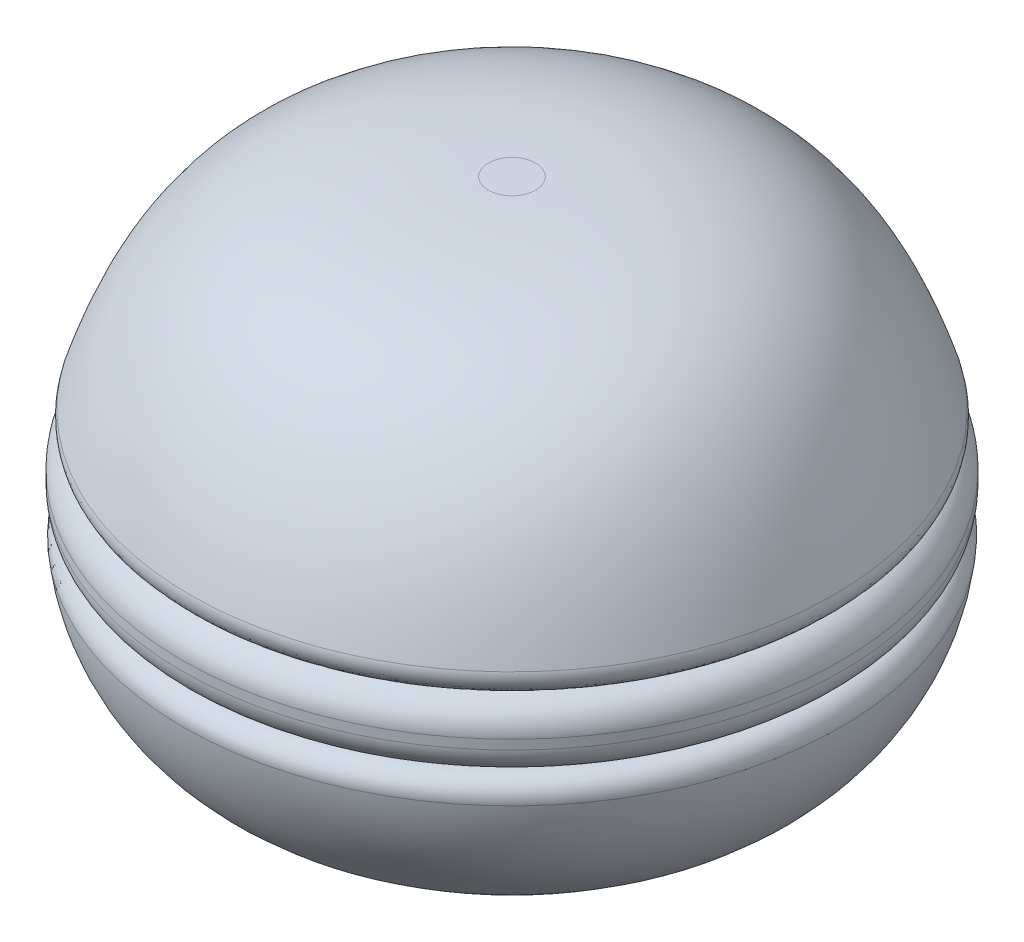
ISO-10303-21;
HEADER;
FILE_DESCRIPTION(('STEP AP214'),'2;1');
FILE_NAME('part.step','',(''),(''),'','','');
FILE_SCHEMA(('AUTOMOTIVE_DESIGN { 1 0 10303 214 1 1 1 1 }'));
ENDSEC;
DATA;
#1=APPLICATION_CONTEXT('core data for automotive mechanical design processes');
#2=APPLICATION_PROTOCOL_DEFINITION('international standard','automotive_design',2000,#1);
#3=PRODUCT_CONTEXT('',#1,'mechanical');
#4=PRODUCT('Part','Part','',(#3));
#5=PRODUCT_RELATED_PRODUCT_CATEGORY('part','',(#4));
#6=PRODUCT_DEFINITION_FORMATION('','',#4);
#7=PRODUCT_DEFINITION_CONTEXT('part definition',#1,'design');
#8=PRODUCT_DEFINITION('design','',#6,#7);
#9=PRODUCT_DEFINITION_SHAPE('','',#8);
#10=(LENGTH_UNIT() NAMED_UNIT(*) SI_UNIT(.MILLI.,.METRE.));
#11=(NAMED_UNIT(*) PLANE_ANGLE_UNIT() SI_UNIT($,.RADIAN.));
#12=(NAMED_UNIT(*) SI_UNIT($,.STERADIAN.) SOLID_ANGLE_UNIT());
#13=UNCERTAINTY_MEASURE_WITH_UNIT(LENGTH_MEASURE(1.E-05),#10,'distance_accuracy_value','');
#14=(GEOMETRIC_REPRESENTATION_CONTEXT(3) GLOBAL_UNCERTAINTY_ASSIGNED_CONTEXT((#13)) GLOBAL_UNIT_ASSIGNED_CONTEXT((#10,
#11,#12)) REPRESENTATION_CONTEXT('',''));
#15=CARTESIAN_POINT('',(0.,0.,0.));
#16=DIRECTION('',(0.,0.,1.));
#17=DIRECTION('',(1.,0.,0.));
#18=AXIS2_PLACEMENT_3D('',#15,#16,#17);
#19=CARTESIAN_POINT('',(0.,-13.5,0.));
#20=DIRECTION('',(0.,-1.,0.));
#21=DIRECTION('',(0.,0.,-1.));
#22=AXIS2_PLACEMENT_3D('',#19,#20,#21);
#23=PLANE('',#22);
#24=CARTESIAN_POINT('',(0.,-13.5,0.));
#25=DIRECTION('',(0.,-1.,0.));
#26=DIRECTION('',(0.,0.,-1.));
#27=AXIS2_PLACEMENT_3D('',#24,#25,#26);
#28=CIRCLE('',#27,7.50000000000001);
#29=CARTESIAN_POINT('',(0.,-13.5,-7.50000000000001));
#30=VERTEX_POINT('',#29);
#31=EDGE_CURVE('E59',#30,#30,#28,.T.);
#32=ORIENTED_EDGE('',*,*,#31,.T.);
#33=EDGE_LOOP('',(#32));
#34=FACE_BOUND('',#33,.T.);
#35=ADVANCED_FACE('F48',(#34),#23,.T.);
#36=CARTESIAN_POINT('',(0.,-3.5,0.));
#37=DIRECTION('',(0.,-1.,0.));
#38=DIRECTION('',(0.,0.,-1.));
#39=AXIS2_PLACEMENT_3D('',#36,#37,#38);
#40=PLANE('',#39);
#41=CARTESIAN_POINT('',(0.,-3.5,0.));
#42=DIRECTION('',(0.,-1.,0.));
#43=DIRECTION('',(0.,0.,-1.));
#44=AXIS2_PLACEMENT_3D('',#41,#42,#43);
#45=CIRCLE('',#44,16.4442719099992);
#46=CARTESIAN_POINT('',(0.,-3.5,-16.4442719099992));
#47=VERTEX_POINT('',#46);
#48=EDGE_CURVE('E11',#47,#47,#45,.F.);
#49=ORIENTED_EDGE('',*,*,#48,.T.);
#50=EDGE_LOOP('',(#49));
#51=FACE_BOUND('',#50,.T.);
#52=ADVANCED_FACE('F69',(#51),#40,.F.);
#53=CARTESIAN_POINT('',(0.,-3.5,0.));
#54=DIRECTION('',(0.,-1.,0.));
#55=DIRECTION('',(0.,0.,-1.));
#56=AXIS2_PLACEMENT_3D('',#53,#54,#55);
#57=DEGENERATE_TOROIDAL_SURFACE('',#56,7.50000000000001,10.,.T.);
#58=CARTESIAN_POINT('',(0.,-4.61111111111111,0.));
#59=DIRECTION('',(0.,1.,0.));
#60=DIRECTION('',(0.,0.,1.));
#61=AXIS2_PLACEMENT_3D('',#58,#59,#60);
#62=CIRCLE('',#61,17.4380798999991);
#63=CARTESIAN_POINT('',(0.,-4.61111111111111,17.4380798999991));
#64=VERTEX_POINT('',#63);
#65=EDGE_CURVE('E55',#64,#64,#62,.F.);
#66=ORIENTED_EDGE('',*,*,#65,.T.);
#67=EDGE_LOOP('',(#66));
#68=FACE_BOUND('',#67,.T.);
#69=ORIENTED_EDGE('',*,*,#31,.F.);
#70=EDGE_LOOP('',(#69));
#71=FACE_BOUND('',#70,.T.);
#72=ADVANCED_FACE('F67',(#68,#71),#57,.T.);
#73=CARTESIAN_POINT('',(0.,-4.5,0.));
#74=DIRECTION('',(0.,-1.,0.));
#75=DIRECTION('',(0.,0.,-1.));
#76=AXIS2_PLACEMENT_3D('',#73,#74,#75);
#77=TOROIDAL_SURFACE('',#76,16.4442719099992,1.);
#78=ORIENTED_EDGE('',*,*,#48,.F.);
#79=EDGE_LOOP('',(#78));
#80=FACE_BOUND('',#79,.T.);
#81=ORIENTED_EDGE('',*,*,#65,.F.);
#82=EDGE_LOOP('',(#81));
#83=FACE_BOUND('',#82,.T.);
#84=ADVANCED_FACE('F50',(#80,#83),#77,.T.);
#85=CLOSED_SHELL('',(#35,#52,#72,#84));
#86=MANIFOLD_SOLID_BREP('B2',#85);
#87=CARTESIAN_POINT('',(0.,-3.5,0.));
#88=DIRECTION('',(0.,1.,0.));
#89=DIRECTION('',(0.,0.,1.));
#90=AXIS2_PLACEMENT_3D('',#87,#88,#89);
#91=CYLINDRICAL_SURFACE('',#90,17.5);
#92=CARTESIAN_POINT('',(0.,-1.5,0.));
#93=DIRECTION('',(0.,-1.,0.));
#94=DIRECTION('',(0.,0.,-1.));
#95=AXIS2_PLACEMENT_3D('',#92,#93,#94);
#96=CIRCLE('',#95,17.5);
#97=CARTESIAN_POINT('',(0.,-1.5,-17.5));
#98=VERTEX_POINT('',#97);
#99=EDGE_CURVE('E122',#98,#98,#96,.T.);
#100=ORIENTED_EDGE('',*,*,#99,.T.);
#101=EDGE_LOOP('',(#100));
#102=FACE_BOUND('',#101,.T.);
#103=CARTESIAN_POINT('',(0.,-2.,0.));
#104=DIRECTION('',(0.,-1.,0.));
#105=DIRECTION('',(0.,0.,-1.));
#106=AXIS2_PLACEMENT_3D('',#103,#104,#105);
#107=CIRCLE('',#106,17.5);
#108=CARTESIAN_POINT('',(0.,-2.,-17.5));
#109=VERTEX_POINT('',#108);
#110=EDGE_CURVE('E126',#109,#109,#107,.F.);
#111=ORIENTED_EDGE('',*,*,#110,.T.);
#112=EDGE_LOOP('',(#111));
#113=FACE_BOUND('',#112,.T.);
#114=ADVANCED_FACE('F111',(#102,#113),#91,.T.);
#115=CARTESIAN_POINT('',(0.,-3.5,0.));
#116=DIRECTION('',(0.,-1.,0.));
#117=DIRECTION('',(0.,0.,-1.));
#118=AXIS2_PLACEMENT_3D('',#115,#116,#117);
#119=PLANE('',#118);
#120=CARTESIAN_POINT('',(0.,-3.5,0.));
#121=DIRECTION('',(0.,-1.,0.));
#122=DIRECTION('',(0.,0.,-1.));
#123=AXIS2_PLACEMENT_3D('',#120,#121,#122);
#124=CIRCLE('',#123,16.);
#125=CARTESIAN_POINT('',(0.,-3.5,-16.));
#126=VERTEX_POINT('',#125);
#127=EDGE_CURVE('E47',#126,#126,#124,.T.);
#128=ORIENTED_EDGE('',*,*,#127,.T.);
#129=EDGE_LOOP('',(#128));
#130=FACE_BOUND('',#129,.T.);
#131=ADVANCED_FACE('F142',(#130),#119,.T.);
#132=CARTESIAN_POINT('',(0.,0.,0.));
#133=DIRECTION('',(0.,-1.,0.));
#134=DIRECTION('',(0.,0.,-1.));
#135=AXIS2_PLACEMENT_3D('',#132,#133,#134);
#136=PLANE('',#135);
#137=CARTESIAN_POINT('',(0.,0.,0.));
#138=DIRECTION('',(0.,-1.,0.));
#139=DIRECTION('',(0.,0.,-1.));
#140=AXIS2_PLACEMENT_3D('',#137,#138,#139);
#141=CIRCLE('',#140,16.);
#142=CARTESIAN_POINT('',(0.,0.,-16.));
#143=VERTEX_POINT('',#142);
#144=EDGE_CURVE('E118',#143,#143,#141,.F.);
#145=ORIENTED_EDGE('',*,*,#144,.T.);
#146=EDGE_LOOP('',(#145));
#147=FACE_BOUND('',#146,.T.);
#148=ADVANCED_FACE('F139',(#147),#136,.F.);
#149=CARTESIAN_POINT('',(0.,-1.5,0.));
#150=DIRECTION('',(0.,-1.,0.));
#151=DIRECTION('',(0.,0.,-1.));
#152=AXIS2_PLACEMENT_3D('',#149,#150,#151);
#153=TOROIDAL_SURFACE('',#152,16.,1.5);
#154=ORIENTED_EDGE('',*,*,#144,.F.);
#155=EDGE_LOOP('',(#154));
#156=FACE_BOUND('',#155,.T.);
#157=ORIENTED_EDGE('',*,*,#99,.F.);
#158=EDGE_LOOP('',(#157));
#159=FACE_BOUND('',#158,.T.);
#160=ADVANCED_FACE('F135',(#156,#159),#153,.T.);
#161=CARTESIAN_POINT('',(0.,-2.,0.));
#162=DIRECTION('',(0.,-1.,0.));
#163=DIRECTION('',(0.,0.,-1.));
#164=AXIS2_PLACEMENT_3D('',#161,#162,#163);
#165=TOROIDAL_SURFACE('',#164,16.,1.5);
#166=ORIENTED_EDGE('',*,*,#110,.F.);
#167=EDGE_LOOP('',(#166));
#168=FACE_BOUND('',#167,.T.);
#169=ORIENTED_EDGE('',*,*,#127,.F.);
#170=EDGE_LOOP('',(#169));
#171=FACE_BOUND('',#170,.T.);
#172=ADVANCED_FACE('F113',(#168,#171),#165,.T.);
#173=CLOSED_SHELL('',(#114,#131,#148,#160,#172));
#174=MANIFOLD_SOLID_BREP('B6',#173);
#175=CARTESIAN_POINT('',(0.,12.,0.));
#176=DIRECTION('',(0.,1.,0.));
#177=DIRECTION('',(0.,0.,1.));
#178=AXIS2_PLACEMENT_3D('',#175,#176,#177);
#179=PLANE('',#178);
#180=CARTESIAN_POINT('',(0.,12.,1.25192319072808));
#181=CARTESIAN_POINT('',(-0.163854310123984,12.,1.25192319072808));
#182=CARTESIAN_POINT('',(-0.491562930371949,12.,1.18673789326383));
#183=CARTESIAN_POINT('',(-0.90828986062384,12.,0.908289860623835));
#184=CARTESIAN_POINT('',(-1.18673789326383,12.,0.491562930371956));
#185=CARTESIAN_POINT('',(-1.28451583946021,12.,0.));
#186=CARTESIAN_POINT('',(-1.18673789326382,12.,-0.491562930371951));
#187=CARTESIAN_POINT('',(-0.908289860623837,12.,-0.908289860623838));
#188=CARTESIAN_POINT('',(-0.491562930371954,12.,-1.18673789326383));
#189=CARTESIAN_POINT('',(0.,12.,-1.2845158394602));
#190=CARTESIAN_POINT('',(0.491562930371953,12.,-1.18673789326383));
#191=CARTESIAN_POINT('',(0.908289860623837,12.,-0.908289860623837));
#192=CARTESIAN_POINT('',(1.18673789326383,12.,-0.491562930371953));
#193=CARTESIAN_POINT('',(1.2845158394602,12.,0.));
#194=CARTESIAN_POINT('',(1.18673789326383,12.,0.491562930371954));
#195=CARTESIAN_POINT('',(0.908289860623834,12.,0.908289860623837));
#196=CARTESIAN_POINT('',(0.491562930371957,12.,1.18673789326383));
#197=CARTESIAN_POINT('',(0.163854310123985,12.,1.25192319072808));
#198=CARTESIAN_POINT('',(0.,12.,1.25192319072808));
#199=B_SPLINE_CURVE_WITH_KNOTS('',3,(#180,#181,#182,#183,#184,#185,#186,#187,#188,#189,#190,
#191,#192,#193,#194,#195,#196,#197,#198),.UNSPECIFIED.,.T.,.F.,(4,1,1,1,1,1,1,1,1,1,1,1,1,1,1,1,
4),(-3.14159265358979,-2.74889357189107,-2.35619449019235,-1.96349540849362,-1.5707963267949,
-1.17809724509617,-0.785398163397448,-0.392699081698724,0.,0.392699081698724,0.785398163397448,
1.17809724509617,1.5707963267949,1.96349540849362,2.35619449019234,2.74889357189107,
3.14159265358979),.UNSPECIFIED.);
#200=CARTESIAN_POINT('',(0.,12.,1.25192319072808));
#201=VERTEX_POINT('',#200);
#202=EDGE_CURVE('E199',#201,#201,#199,.F.);
#203=ORIENTED_EDGE('',*,*,#202,.T.);
#204=EDGE_LOOP('',(#203));
#205=FACE_BOUND('',#204,.T.);
#206=ADVANCED_FACE('F182',(#205),#179,.T.);
#207=CARTESIAN_POINT('',(0.,0.,0.));
#208=DIRECTION('',(0.,1.,0.));
#209=DIRECTION('',(0.,0.,1.));
#210=AXIS2_PLACEMENT_3D('',#207,#208,#209);
#211=PLANE('',#210);
#212=CARTESIAN_POINT('',(2.17183486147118,1.30773434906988,16.9511947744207));
#213=CARTESIAN_POINT('',(2.22575622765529,0.,17.3707036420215));
#214=CARTESIAN_POINT('',(2.05053572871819,0.,16.0074860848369));
#215=CARTESIAN_POINT('',(1.69550539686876,1.30773757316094,17.0124173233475));
#216=CARTESIAN_POINT('',(1.7376896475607,0.,17.4334411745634));
#217=CARTESIAN_POINT('',(1.60060932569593,0.,16.0653152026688));
#218=CARTESIAN_POINT('',(1.21649828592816,1.30774244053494,17.0536614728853));
#219=CARTESIAN_POINT('',(1.24684856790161,0.,17.4757163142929));
#220=CARTESIAN_POINT('',(1.14822434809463,0.,16.1042615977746));
#221=CARTESIAN_POINT('',(0.496444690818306,1.30774720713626,17.0850059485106));
#222=CARTESIAN_POINT('',(0.508861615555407,0.,17.5078494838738));
#223=CARTESIAN_POINT('',(0.468513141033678,0.,16.1338531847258));
#224=CARTESIAN_POINT('',(0.256149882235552,1.30774837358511,17.0903663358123));
#225=CARTESIAN_POINT('',(0.26255814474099,0.,17.5133464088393));
#226=CARTESIAN_POINT('',(0.241735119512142,0.,16.1389116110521));
#227=CARTESIAN_POINT('',(-0.224457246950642,1.30774845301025,17.0908165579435));
#228=CARTESIAN_POINT('',(-0.230070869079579,0.,17.5138080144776));
#229=CARTESIAN_POINT('',(-0.211829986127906,0.,16.1393365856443));
#230=CARTESIAN_POINT('',(-0.464769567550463,1.30774736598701,17.0859063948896));
#231=CARTESIAN_POINT('',(-0.476395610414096,0.,17.5087726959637));
#232=CARTESIAN_POINT('',(-0.438617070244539,0.,16.1347031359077));
#233=CARTESIAN_POINT('',(-1.18485132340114,1.30774274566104,17.055906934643));
#234=CARTESIAN_POINT('',(-1.21441892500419,0.,17.4780181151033));
#235=CARTESIAN_POINT('',(-1.11833818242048,0.,16.1063816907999));
#236=CARTESIAN_POINT('',(-1.66389152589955,1.30773785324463,17.0155540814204));
#237=CARTESIAN_POINT('',(-1.70529546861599,0.,17.4366559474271));
#238=CARTESIAN_POINT('',(-1.57075086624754,0.,16.0682777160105));
#239=CARTESIAN_POINT('',(-2.61673020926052,1.30773127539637,16.8948798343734));
#240=CARTESIAN_POINT('',(-2.68161282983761,0.,17.3129950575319));
#241=CARTESIAN_POINT('',(-2.4707683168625,0.,15.9542929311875));
#242=CARTESIAN_POINT('',(-3.09052822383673,1.30772959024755,16.8145549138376));
#243=CARTESIAN_POINT('',(-3.16705545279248,0.,17.2306926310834));
#244=CARTESIAN_POINT('',(-2.91837265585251,0.,15.8784087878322));
#245=CARTESIAN_POINT('',(-4.02942922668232,1.30773099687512,16.6146591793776));
#246=CARTESIAN_POINT('',(-4.12904137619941,0.,17.0258850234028));
#247=CARTESIAN_POINT('',(-3.80534295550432,0.,15.6895689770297));
#248=CARTESIAN_POINT('',(-4.49453843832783,1.30773408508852,16.495117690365));
#249=CARTESIAN_POINT('',(-4.60559435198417,0.,16.9034091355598));
#250=CARTESIAN_POINT('',(-4.24471481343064,0.,15.5766410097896));
#251=CARTESIAN_POINT('',(-5.41334372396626,1.30774203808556,16.2173232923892));
#252=CARTESIAN_POINT('',(-5.54710662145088,0.,16.6187649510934));
#253=CARTESIAN_POINT('',(-5.112449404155,0.,15.3142899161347));
#254=CARTESIAN_POINT('',(-5.86704091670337,1.30774690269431,16.0590741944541));
#255=CARTESIAN_POINT('',(-6.01206819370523,0.,16.4565999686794));
#256=CARTESIAN_POINT('',(-5.54081321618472,0.,15.1648703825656));
#257=CARTESIAN_POINT('',(-6.53643177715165,1.30774862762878,15.7930916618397));
#258=CARTESIAN_POINT('',(-6.69819631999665,0.,16.1839693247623));
#259=CARTESIAN_POINT('',(-6.17255827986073,0.,14.9138491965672));
#260=CARTESIAN_POINT('',(-6.75772790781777,1.30774827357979,15.6996501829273));
#261=CARTESIAN_POINT('',(-6.92504483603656,0.,16.0881827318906));
#262=CARTESIAN_POINT('',(-6.38136343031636,0.,14.8256817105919));
#263=CARTESIAN_POINT('',(-7.19602085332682,1.30774601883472,15.5035052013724));
#264=CARTESIAN_POINT('',(-7.37428030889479,0.,15.8871368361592));
#265=CARTESIAN_POINT('',(-6.79503777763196,0.,14.6405518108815));
#266=CARTESIAN_POINT('',(-7.41301764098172,1.30774411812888,15.4008016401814));
#267=CARTESIAN_POINT('',(-7.59666674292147,0.,15.7818777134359));
#268=CARTESIAN_POINT('',(-6.99990694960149,0.,14.5435893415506));
#269=CARTESIAN_POINT('',(-8.05714283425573,1.30773817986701,15.0791387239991));
#270=CARTESIAN_POINT('',(-8.2567500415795,0.,15.4522329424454));
#271=CARTESIAN_POINT('',(-7.60812113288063,0.,14.2398585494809));
#272=CARTESIAN_POINT('',(-8.47746909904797,1.30773390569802,14.8466020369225));
#273=CARTESIAN_POINT('',(-8.68743717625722,0.,15.213953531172));
#274=CARTESIAN_POINT('',(-8.00513229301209,0.,14.0202231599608));
#275=CARTESIAN_POINT('',(-9.29696139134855,1.30772962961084,14.3473681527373));
#276=CARTESIAN_POINT('',(-9.52709125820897,0.,14.7024282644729));
#277=CARTESIAN_POINT('',(-8.77925831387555,0.,13.5486237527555));
#278=CARTESIAN_POINT('',(-9.69613166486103,1.3077296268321,14.0806778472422));
#279=CARTESIAN_POINT('',(-9.93606521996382,0.,14.4291879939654));
#280=CARTESIAN_POINT('',(-9.15637716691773,0.,13.2966662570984));
#281=CARTESIAN_POINT('',(-10.4709203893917,1.30773389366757,13.5147606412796));
#282=CARTESIAN_POINT('',(-10.7299239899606,0.,13.8493510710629));
#283=CARTESIAN_POINT('',(-9.88827692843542,0.,12.7620785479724));
#284=CARTESIAN_POINT('',(-10.8465402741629,1.30773816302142,13.2155357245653));
#285=CARTESIAN_POINT('',(-11.1148126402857,0.,13.542754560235));
#286=CARTESIAN_POINT('',(-10.2430591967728,0.,12.4794502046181));
#287=CARTESIAN_POINT('',(-11.3901496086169,1.30774410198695,12.743703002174));
#288=CARTESIAN_POINT('',(-11.6719013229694,0.,13.0592373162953));
#289=CARTESIAN_POINT('',(-10.7563629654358,0.,12.0339228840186));
#290=CARTESIAN_POINT('',(-11.5680723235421,1.30774600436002,12.5825692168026));
#291=CARTESIAN_POINT('',(-11.854247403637,0.,12.8941032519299));
#292=CARTESIAN_POINT('',(-10.9243410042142,0.,11.8817939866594));
#293=CARTESIAN_POINT('',(-11.9170090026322,1.30774826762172,12.252786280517));
#294=CARTESIAN_POINT('',(-12.2118992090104,0.,12.5560885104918));
#295=CARTESIAN_POINT('',(-11.2536805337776,0.,11.5705352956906));
#296=CARTESIAN_POINT('',(-12.0880230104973,1.3077486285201,12.0841371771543));
#297=CARTESIAN_POINT('',(-12.3872045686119,0.,12.38320824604));
#298=CARTESIAN_POINT('',(-11.4150420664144,0.,11.4114055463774));
#299=CARTESIAN_POINT('',(-12.5899355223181,1.30774691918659,11.5676075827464));
#300=CARTESIAN_POINT('',(-12.901664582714,0.,11.8537625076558));
#301=CARTESIAN_POINT('',(-11.8887248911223,0.,10.9239240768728));
#302=CARTESIAN_POINT('',(-12.9097773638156,1.30774205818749,11.2090815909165));
#303=CARTESIAN_POINT('',(-13.2294355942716,0.,11.486329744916));
#304=CARTESIAN_POINT('',(-12.1907131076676,0.,10.5854205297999));
#305=CARTESIAN_POINT('',(-13.5181716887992,1.30773410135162,10.4665633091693));
#306=CARTESIAN_POINT('',(-13.8528514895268,0.,10.7254548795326));
#307=CARTESIAN_POINT('',(-12.765287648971,0.,9.88417407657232));
#308=CARTESIAN_POINT('',(-13.8067114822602,1.30773100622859,10.0825607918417));
#309=CARTESIAN_POINT('',(-14.1484843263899,0.,10.332001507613));
#310=CARTESIAN_POINT('',(-13.0378620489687,0.,9.52142143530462));
#311=CARTESIAN_POINT('',(-14.3507006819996,1.30772958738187,9.29181186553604));
#312=CARTESIAN_POINT('',(-14.7058458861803,0.,9.52180915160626));
#313=CARTESIAN_POINT('',(-13.551763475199,0.,8.77440900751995));
#314=CARTESIAN_POINT('',(-14.6061493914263,1.30773126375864,8.88506497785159));
#315=CARTESIAN_POINT('',(-14.967575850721,0.,9.10506690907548));
#316=CARTESIAN_POINT('',(-13.7930898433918,0.,8.39014876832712));
#317=CARTESIAN_POINT('',(-15.0821913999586,1.30773782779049,8.05139036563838));
#318=CARTESIAN_POINT('',(-15.455359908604,0.,8.25085508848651));
#319=CARTESIAN_POINT('',(-14.242742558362,0.,7.60268916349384));
#320=CARTESIAN_POINT('',(-15.3027831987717,1.30774271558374,7.62446177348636));
#321=CARTESIAN_POINT('',(-15.6814134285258,0.,7.81338253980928));
#322=CARTESIAN_POINT('',(-14.4510674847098,0.,7.19948898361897));
#323=CARTESIAN_POINT('',(-15.6060623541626,1.30774734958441,6.97100684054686));
#324=CARTESIAN_POINT('',(-15.9922558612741,0.,7.14364979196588));
#325=CARTESIAN_POINT('',(-14.7373517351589,0.,6.58265995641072));
#326=CARTESIAN_POINT('',(-15.7025609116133,1.30774844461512,6.75099253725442));
#327=CARTESIAN_POINT('',(-16.0911707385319,0.,6.9181321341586));
#328=CARTESIAN_POINT('',(-14.8284191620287,0.,6.37502758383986));
#329=CARTESIAN_POINT('',(-15.8860731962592,1.30774838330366,6.30704977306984));
#330=CARTESIAN_POINT('',(-16.2792733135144,0.,6.46308454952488));
#331=CARTESIAN_POINT('',(-15.0016057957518,0.,5.95606389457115));
#332=CARTESIAN_POINT('',(-15.9730869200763,1.30774722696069,6.08312131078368));
#333=CARTESIAN_POINT('',(-16.3684607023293,0.,6.23355536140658));
#334=CARTESIAN_POINT('',(-15.0837249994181,0.,5.74473257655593));
#335=CARTESIAN_POINT('',(-16.2198834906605,1.30774247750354,5.40582314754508));
#336=CARTESIAN_POINT('',(-16.6213968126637,0.,5.53938476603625));
#337=CARTESIAN_POINT('',(-15.3166905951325,0.,5.10538201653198));
#338=CARTESIAN_POINT('',(-16.3652568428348,1.30773760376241,4.94729644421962));
#339=CARTESIAN_POINT('',(-16.770350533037,0.,5.06952528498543));
#340=CARTESIAN_POINT('',(-15.4539894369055,0.,4.67234167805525));
#341=CARTESIAN_POINT('',(-16.6170124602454,1.30773113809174,4.01984216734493));
#342=CARTESIAN_POINT('',(-17.0282971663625,0.,4.11921491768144));
#343=CARTESIAN_POINT('',(-15.6917897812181,0.,3.7962967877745));
#344=CARTESIAN_POINT('',(-16.7233912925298,1.30772954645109,3.55091368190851));
#345=CARTESIAN_POINT('',(-17.1372873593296,0.,3.63876089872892));
#346=CARTESIAN_POINT('',(-15.7922880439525,0.,3.35329136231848));
#347=CARTESIAN_POINT('',(-16.8965704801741,1.30773113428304,2.60576602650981));
#348=CARTESIAN_POINT('',(-17.3147276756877,0.,2.67037603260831));
#349=CARTESIAN_POINT('',(-15.9558883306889,0.,2.46041958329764));
#350=CARTESIAN_POINT('',(-16.9633701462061,1.30773431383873,2.12954672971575));
#351=CARTESIAN_POINT('',(-17.3831776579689,0.,2.18244170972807));
#352=CARTESIAN_POINT('',(-16.0189897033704,0.,2.0105531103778));
#353=CARTESIAN_POINT('',(-17.0567116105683,1.30774232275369,1.17288618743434));
#354=CARTESIAN_POINT('',(-17.4788408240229,0.,1.20213802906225));
#355=CARTESIAN_POINT('',(-16.1071441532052,0.,1.10708299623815));
#356=CARTESIAN_POINT('',(-17.0832573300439,1.3077471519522,0.692445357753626));
#357=CARTESIAN_POINT('',(-17.5060578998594,0.,0.709767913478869));
#358=CARTESIAN_POINT('',(-16.1322009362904,0.,0.653479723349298));
#359=CARTESIAN_POINT('',(-17.0922845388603,1.30774863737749,-0.0291454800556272));
#360=CARTESIAN_POINT('',(-17.515312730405,0.,-0.0298653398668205));
#361=CARTESIAN_POINT('',(-16.1407227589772,0.,-0.0275267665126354));
#362=CARTESIAN_POINT('',(-17.0901463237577,1.30774816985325,-0.270041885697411));
#363=CARTESIAN_POINT('',(-17.5131200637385,0.,-0.276805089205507));
#364=CARTESIAN_POINT('',(-16.1387049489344,0.,-0.25482834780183));
#365=CARTESIAN_POINT('',(-17.0756150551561,1.30774576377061,-0.751381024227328));
#366=CARTESIAN_POINT('',(-17.4982222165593,0.,-0.770159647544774));
#367=CARTESIAN_POINT('',(-16.1249875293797,0.,-0.709139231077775));
#368=CARTESIAN_POINT('',(-17.063221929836,1.3077438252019,-0.991823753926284));
#369=CARTESIAN_POINT('',(-17.4855169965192,0.,-1.01657392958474));
#370=CARTESIAN_POINT('',(-16.1132878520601,0.,-0.936148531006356));
#371=CARTESIAN_POINT('',(-17.0108139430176,1.30773783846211,-1.71196007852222));
#372=CARTESIAN_POINT('',(-17.4317991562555,0.,-1.75455078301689));
#373=CARTESIAN_POINT('',(-16.0637998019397,0.,-1.61614902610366));
#374=CARTESIAN_POINT('',(-16.955571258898,1.30773361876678,-2.19052888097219));
#375=CARTESIAN_POINT('',(-17.3751852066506,0.,-2.24491800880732));
#376=CARTESIAN_POINT('',(-16.0116231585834,0.,-2.06817611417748));
#377=CARTESIAN_POINT('',(-16.8052049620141,1.30772955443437,-3.14114770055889));
#378=CARTESIAN_POINT('',(-17.2211120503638,0.,-3.21892588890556));
#379=CARTESIAN_POINT('',(-15.8695778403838,0.,-2.96617561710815));
#380=CARTESIAN_POINT('',(-16.7100822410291,1.30772970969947,-3.61319786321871));
#381=CARTESIAN_POINT('',(-17.1236533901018,0.,-3.7025697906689));
#382=CARTESIAN_POINT('',(-15.7797100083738,0.,-3.41214816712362));
#383=CARTESIAN_POINT('',(-16.4805423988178,1.30773423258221,-4.54783049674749));
#384=CARTESIAN_POINT('',(-16.8884723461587,0.,-4.66020580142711));
#385=CARTESIAN_POINT('',(-15.5628804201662,0.,-4.29503694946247));
#386=CARTESIAN_POINT('',(-16.346127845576,1.30773859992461,-5.01041358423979));
#387=CARTESIAN_POINT('',(-16.7507517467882,0.,-5.13420142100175));
#388=CARTESIAN_POINT('',(-15.4359210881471,0.,-4.73195377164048));
#389=CARTESIAN_POINT('',(-16.1155643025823,1.30774450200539,-5.69448454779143));
#390=CARTESIAN_POINT('',(-16.5144824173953,0.,-5.83523640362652));
#391=CARTESIAN_POINT('',(-15.2182181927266,0.,-5.37787119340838));
#392=CARTESIAN_POINT('',(-16.0339050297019,1.30774636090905,-5.92083080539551));
#393=CARTESIAN_POINT('',(-16.4307970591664,0.,-6.06721082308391));
#394=CARTESIAN_POINT('',(-15.1411243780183,0.,-5.59155969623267));
#395=CARTESIAN_POINT('',(-15.8609589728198,1.30774840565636,-6.3699617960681));
#396=CARTESIAN_POINT('',(-16.2535340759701,0.,-6.52756152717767));
#397=CARTESIAN_POINT('',(-14.9778974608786,0.,-6.01545603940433));
#398=CARTESIAN_POINT('',(-15.769672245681,1.3077485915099,-6.592746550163));
#399=CARTESIAN_POINT('',(-16.15995670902,0.,-6.7559372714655));
#400=CARTESIAN_POINT('',(-14.8917644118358,0.,-6.22566390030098));
#401=CARTESIAN_POINT('',(-15.4817421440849,1.30774649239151,-7.2547864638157));
#402=CARTESIAN_POINT('',(-15.864826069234,0.,-7.43452631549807));
#403=CARTESIAN_POINT('',(-14.6200226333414,0.,-6.85047440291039));
#404=CARTESIAN_POINT('',(-15.2709984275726,1.30774155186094,-7.68781754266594));
#405=CARTESIAN_POINT('',(-15.6488443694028,0.,-7.87829124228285));
#406=CARTESIAN_POINT('',(-14.4210425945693,0.,-7.25934907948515));
#407=CARTESIAN_POINT('',(-14.814019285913,1.30773367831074,-8.53432711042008));
#408=CARTESIAN_POINT('',(-15.1805655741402,0.,-8.74570086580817));
#409=CARTESIAN_POINT('',(-13.9894517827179,0.,-8.05882553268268));
#410=CARTESIAN_POINT('',(-14.5677866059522,1.30773074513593,-8.94780710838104));
#411=CARTESIAN_POINT('',(-14.9282708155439,0.,-9.16934848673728));
#412=CARTESIAN_POINT('',(-13.7568436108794,0.,-8.44942871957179));
#413=CARTESIAN_POINT('',(-14.0415914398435,1.30772969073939,-9.75270129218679));
#414=CARTESIAN_POINT('',(-14.3891365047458,0.,-9.99403097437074));
#415=CARTESIAN_POINT('',(-13.2597525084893,0.,-9.20980441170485));
#416=CARTESIAN_POINT('',(-13.7616284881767,1.30773156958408,-10.1441151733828));
#417=CARTESIAN_POINT('',(-14.1022946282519,0.,-10.3950684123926));
#418=CARTESIAN_POINT('',(-12.9952691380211,0.,-9.57957662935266));
#419=CARTESIAN_POINT('',(-13.1700943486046,1.30773839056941,-10.9017150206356));
#420=CARTESIAN_POINT('',(-13.4961911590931,0.,-11.1713498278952));
#421=CARTESIAN_POINT('',(-12.4365341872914,0.,-10.2951693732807));
#422=CARTESIAN_POINT('',(-12.8585669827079,1.30774332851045,-11.2679348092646));
#423=CARTESIAN_POINT('',(-13.176973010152,0.,-11.5466299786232));
#424=CARTESIAN_POINT('',(-12.1423238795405,0.,-10.6410220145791));
#425=CARTESIAN_POINT('',(-12.3686640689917,1.30774764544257,-11.7966488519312));
#426=CARTESIAN_POINT('',(-12.6748595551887,0.,-12.0885320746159));
#427=CARTESIAN_POINT('',(-11.6799027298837,0.,-11.1400826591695));
#428=CARTESIAN_POINT('',(-12.2015788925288,1.30774856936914,-11.9694651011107));
#429=CARTESIAN_POINT('',(-12.5035914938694,0.,-12.2656774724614));
#430=CARTESIAN_POINT('',(-11.5222300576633,0.,-11.3031631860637));
#431=CARTESIAN_POINT('',(-11.8602051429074,1.30774818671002,-12.3077780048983));
#432=CARTESIAN_POINT('',(-12.1536786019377,0.,-12.6124521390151));
#433=CARTESIAN_POINT('',(-11.2000630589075,0.,-11.6224409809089));
#434=CARTESIAN_POINT('',(-11.6859165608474,1.30774688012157,-12.4732746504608));
#435=CARTESIAN_POINT('',(-11.9750343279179,0.,-12.7820808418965));
#436=CARTESIAN_POINT('',(-11.0355687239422,0.,-11.7786382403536));
#437=CARTESIAN_POINT('',(-11.1528553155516,1.30774186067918,-12.9583906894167));
#438=CARTESIAN_POINT('',(-11.4287010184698,0.,-13.2792634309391));
#439=CARTESIAN_POINT('',(-10.5323483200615,0.,-12.2365935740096));
#440=CARTESIAN_POINT('',(-10.7838606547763,1.30773704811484,-13.2666647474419));
#441=CARTESIAN_POINT('',(-11.0505842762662,0.,-13.5951433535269));
#442=CARTESIAN_POINT('',(-10.1838598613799,0.,-12.5277421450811));
#443=CARTESIAN_POINT('',(-10.0214885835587,1.30773085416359,-13.8511091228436));
#444=CARTESIAN_POINT('',(-10.2694233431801,0.,-14.193976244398));
#445=CARTESIAN_POINT('',(-9.46373829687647,0.,-13.0797960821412));
#446=CARTESIAN_POINT('',(-9.62810952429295,1.30772947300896,-14.1272772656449));
#447=CARTESIAN_POINT('',(-9.86637564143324,0.,-14.4769286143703));
#448=CARTESIAN_POINT('',(-9.09210362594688,0.,-13.3406993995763));
#449=CARTESIAN_POINT('',(-8.81979512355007,1.30773144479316,-14.6456670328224));
#450=CARTESIAN_POINT('',(-9.0381897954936,0.,-15.008067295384));
#451=CARTESIAN_POINT('',(-8.32849691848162,0.,-13.8304165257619));
#452=CARTESIAN_POINT('',(-8.40486957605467,1.30773479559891,-14.8879038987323));
#453=CARTESIAN_POINT('',(-8.6130588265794,0.,-15.2562709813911));
#454=CARTESIAN_POINT('',(-7.93653412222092,0.,-14.0592447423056));
#455=CARTESIAN_POINT('',(-7.55581318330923,1.30774286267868,-15.3368014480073));
#456=CARTESIAN_POINT('',(-7.74301244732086,0.,-15.7162823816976));
#457=CARTESIAN_POINT('',(-7.13471303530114,0.,-14.4831730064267));
#458=CARTESIAN_POINT('',(-7.12168296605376,1.30774757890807,-15.5434632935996));
#459=CARTESIAN_POINT('',(-7.29809671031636,0.,-15.9280915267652));
#460=CARTESIAN_POINT('',(-6.72485532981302,0.,-14.6782741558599));
#461=CARTESIAN_POINT('',(-6.45851934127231,1.30774862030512,-15.825112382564));
#462=CARTESIAN_POINT('',(-6.61835135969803,0.,-16.216784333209));
#463=CARTESIAN_POINT('',(-6.09899187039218,0.,-14.9440836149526));
#464=CARTESIAN_POINT('',(-6.23553728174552,1.30774796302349,-15.914249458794));
#465=CARTESIAN_POINT('',(-6.38977741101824,0.,-16.3081554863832));
#466=CARTESIAN_POINT('',(-5.88858794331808,0.,-15.0281923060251));
#467=CARTESIAN_POINT('',(-5.78612702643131,1.30774533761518,-16.082931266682));
#468=CARTESIAN_POINT('',(-5.9291526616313,0.,-16.4810419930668));
#469=CARTESIAN_POINT('',(-5.46439997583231,0.,-15.187404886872));
#470=CARTESIAN_POINT('',(-5.55969890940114,1.30774336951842,-16.1624762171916));
#471=CARTESIAN_POINT('',(-5.6971023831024,0.,-16.5625574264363));
#472=CARTESIAN_POINT('',(-5.25061601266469,0.,-15.2625089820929));
#473=CARTESIAN_POINT('',(-4.87591302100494,1.30773735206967,-16.3866285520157));
#474=CARTESIAN_POINT('',(-4.99637992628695,0.,-16.7922496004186));
#475=CARTESIAN_POINT('',(-4.60492199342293,0.,-15.4741734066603));
#476=CARTESIAN_POINT('',(-4.41389016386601,1.30773318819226,-16.516822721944));
#477=CARTESIAN_POINT('',(-4.52296666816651,0.,-16.9256440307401));
#478=CARTESIAN_POINT('',(-4.16851545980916,0.,-15.5971512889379));
#479=CARTESIAN_POINT('',(-3.30135886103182,1.30772887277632,-16.7806365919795));
#480=CARTESIAN_POINT('',(-3.38306073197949,0.,-17.1959417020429));
#481=CARTESIAN_POINT('',(-3.11756465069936,0.,-15.8463595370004));
#482=CARTESIAN_POINT('',(-2.64654596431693,1.30773087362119,-16.8964051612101));
#483=CARTESIAN_POINT('',(-2.71216963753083,0.,-17.3145567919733));
#484=CARTESIAN_POINT('',(-2.49891524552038,0.,-15.9557346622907));
#485=CARTESIAN_POINT('',(-1.65781512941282,1.30773805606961,-17.0126278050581));
#486=CARTESIAN_POINT('',(-1.6990626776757,0.,-17.433658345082));
#487=CARTESIAN_POINT('',(-1.56502684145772,0.,-16.0655127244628));
#488=CARTESIAN_POINT('',(-1.32712610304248,1.30774114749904,-17.0417970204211));
#489=CARTESIAN_POINT('',(-1.36020256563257,0.,-17.4635555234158));
#490=CARTESIAN_POINT('',(-1.25271965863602,0.,-16.0930580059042));
#491=CARTESIAN_POINT('',(-0.664293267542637,1.30774632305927,-17.0807838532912));
#492=CARTESIAN_POINT('',(-0.680894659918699,0.,-17.5035201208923));
#493=CARTESIAN_POINT('',(-0.626948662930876,0.,-16.1298684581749));
#494=CARTESIAN_POINT('',(-0.332149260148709,1.30774840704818,-17.0905987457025));
#495=CARTESIAN_POINT('',(-0.340447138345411,0.,-17.5135846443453));
#496=CARTESIAN_POINT('',(-0.31348469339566,0.,-16.1391310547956));
#497=CARTESIAN_POINT('',(0.448035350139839,1.3077484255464,-17.0905990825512));
#498=CARTESIAN_POINT('',(0.459228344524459,0.,-17.5135851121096));
#499=CARTESIAN_POINT('',(0.422858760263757,0.,-16.1391312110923));
#500=CARTESIAN_POINT('',(0.896080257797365,1.30774465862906,-17.0727410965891));
#501=CARTESIAN_POINT('',(0.918451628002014,0.,-17.4952731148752));
#502=CARTESIAN_POINT('',(0.845755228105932,0.,-16.1222778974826));
#503=CARTESIAN_POINT('',(1.78909630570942,1.30773714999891,-17.0019269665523));
#504=CARTESIAN_POINT('',(1.83360351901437,0.,-17.4226914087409));
#505=CARTESIAN_POINT('',(1.68897326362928,0.,-16.0554063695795));
#506=CARTESIAN_POINT('',(2.23406680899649,1.30773340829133,-16.9489637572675));
#507=CARTESIAN_POINT('',(2.28953148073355,0.,-17.3684146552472));
#508=CARTESIAN_POINT('',(2.10929429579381,0.,-16.0053814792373));
#509=CARTESIAN_POINT('',(3.11884527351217,1.30772967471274,-16.8084465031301));
#510=CARTESIAN_POINT('',(3.1960705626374,0.,-17.2244336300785));
#511=CARTESIAN_POINT('',(2.9451176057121,0.,-15.872639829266));
#512=CARTESIAN_POINT('',(3.55864828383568,1.30772968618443,-16.7208616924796));
#513=CARTESIAN_POINT('',(3.64667906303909,0.,-17.1346975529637));
#514=CARTESIAN_POINT('',(3.3606152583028,0.,-15.7898939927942));
#515=CARTESIAN_POINT('',(4.43018651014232,1.30773346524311,-16.5115805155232));
#516=CARTESIAN_POINT('',(4.53966520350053,0.,-16.9202734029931));
#517=CARTESIAN_POINT('',(4.1839078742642,0.,-15.5921989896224));
#518=CARTESIAN_POINT('',(4.86192204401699,1.30773723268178,-16.3898854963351));
#519=CARTESIAN_POINT('',(4.98204556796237,0.,-16.7955860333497));
#520=CARTESIAN_POINT('',(4.59170314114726,0.,-15.4772510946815));
#521=CARTESIAN_POINT('',(5.51714934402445,1.30774299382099,-16.177039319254));
#522=CARTESIAN_POINT('',(5.65349677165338,0.,-16.5774811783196));
#523=CARTESIAN_POINT('',(5.21044137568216,0.,-15.2762592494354));
#524=CARTESIAN_POINT('',(5.74450048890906,1.30774500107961,-16.0978368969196));
#525=CARTESIAN_POINT('',(5.88649077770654,0.,-16.4963176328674));
#526=CARTESIAN_POINT('',(5.42510190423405,0.,-15.201476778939));
#527=CARTESIAN_POINT('',(6.19576239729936,1.3077477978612,-15.9297773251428));
#528=CARTESIAN_POINT('',(6.34900896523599,0.,-16.3240709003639));
#529=CARTESIAN_POINT('',(5.8510477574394,0.,-15.042847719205));
#530=CARTESIAN_POINT('',(6.41967314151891,1.30774858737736,-15.8409201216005));
#531=CARTESIAN_POINT('',(6.57853271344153,0.,-16.2329877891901));
#532=CARTESIAN_POINT('',(6.06233306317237,0.,-14.9590010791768));
#533=CARTESIAN_POINT('',(7.08530231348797,1.30774784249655,-15.5601340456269));
#534=CARTESIAN_POINT('',(7.26080485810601,0.,-15.9451802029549));
#535=CARTESIAN_POINT('',(6.69052497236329,0.,-14.6940058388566));
#536=CARTESIAN_POINT('',(7.52098926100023,1.30774319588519,-15.3539674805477));
#537=CARTESIAN_POINT('',(7.70732372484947,0.,-15.7338753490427));
#538=CARTESIAN_POINT('',(7.10183508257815,0.,-14.4993800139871));
#539=CARTESIAN_POINT('',(8.37307726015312,1.30773508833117,-14.9058642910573));
#540=CARTESIAN_POINT('',(8.58048472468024,0.,-15.2746739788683));
#541=CARTESIAN_POINT('',(7.90650110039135,0.,-14.0762106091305));
#542=CARTESIAN_POINT('',(8.78947970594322,1.30773162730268,-14.6639302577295));
#543=CARTESIAN_POINT('',(9.00712915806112,0.,-15.0267799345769));
#544=CARTESIAN_POINT('',(8.29985830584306,0.,-13.8476694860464));
#545=CARTESIAN_POINT('',(9.60053491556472,1.30772944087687,-14.1460591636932));
#546=CARTESIAN_POINT('',(9.83812292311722,0.,-14.4961722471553));
#547=CARTESIAN_POINT('',(9.06605434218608,0.,-13.3584425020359));
#548=CARTESIAN_POINT('',(9.99518738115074,1.30773071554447,-13.8701216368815));
#549=CARTESIAN_POINT('',(10.24247482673,0.,-14.2134563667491));
#550=CARTESIAN_POINT('',(9.43889289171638,0.,-13.0977562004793));
#551=CARTESIAN_POINT('',(10.7592743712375,1.30773677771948,-13.2865875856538));
#552=CARTESIAN_POINT('',(11.0253910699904,0.,-13.615557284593));
#553=CARTESIAN_POINT('',(10.1606380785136,0.,-12.5465593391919));
#554=CARTESIAN_POINT('',(11.1287614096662,1.3077415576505,-12.9790605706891));
#555=CARTESIAN_POINT('',(11.4040109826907,0.,-13.3004437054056));
#556=CARTESIAN_POINT('',(10.5095945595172,0.,-12.256114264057));
#557=CARTESIAN_POINT('',(11.6626262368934,1.30774669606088,-12.4950385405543));
#558=CARTESIAN_POINT('',(11.9511628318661,0.,-12.8043873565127));
#559=CARTESIAN_POINT('',(11.013585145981,0.,-11.7991809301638));
#560=CARTESIAN_POINT('',(11.8372002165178,1.30774807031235,-12.3298949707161));
#561=CARTESIAN_POINT('',(12.1300974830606,0.,-12.6351228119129));
#562=CARTESIAN_POINT('',(11.1783538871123,0.,-11.6433120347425));
#563=CARTESIAN_POINT('',(12.17917092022,1.30774861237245,-11.9922678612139));
#564=CARTESIAN_POINT('',(12.4806220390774,0.,-12.2890516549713));
#565=CARTESIAN_POINT('',(11.5010852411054,0.,-11.3246807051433));
#566=CARTESIAN_POINT('',(12.3465676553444,1.30774778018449,-11.8197843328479));
#567=CARTESIAN_POINT('',(12.6522113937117,0.,-12.1122456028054));
#568=CARTESIAN_POINT('',(11.6590478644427,0.,-11.1619182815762));
#569=CARTESIAN_POINT('',(12.8373902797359,1.30774363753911,-11.2920793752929));
#570=CARTESIAN_POINT('',(13.1552721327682,0.,-11.5713733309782));
#571=CARTESIAN_POINT('',(12.1223273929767,0.,-10.6638204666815));
#572=CARTESIAN_POINT('',(13.1495435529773,1.30773868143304,-10.9265173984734));
#573=CARTESIAN_POINT('',(13.4751330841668,0.,-11.1967653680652));
#574=CARTESIAN_POINT('',(12.4171255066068,0.,-10.3185932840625));
#575=CARTESIAN_POINT('',(13.7420033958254,1.30773174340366,-10.1706689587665));
#576=CARTESIAN_POINT('',(14.082186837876,0.,-10.4222758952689));
#577=CARTESIAN_POINT('',(12.9767305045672,0.,-9.60466036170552));
#578=CARTESIAN_POINT('',(14.0223070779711,1.30772976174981,-9.78038025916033));
#579=CARTESIAN_POINT('',(14.3693781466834,0.,-10.0223905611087));
#580=CARTESIAN_POINT('',(13.2415346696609,0.,-9.23595249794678));
#581=CARTESIAN_POINT('',(14.5491475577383,1.30773060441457,-8.97801039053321));
#582=CARTESIAN_POINT('',(14.9091733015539,0.,-9.20029412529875));
#583=CARTESIAN_POINT('',(13.7392353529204,0.,-8.47796172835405));
#584=CARTESIAN_POINT('',(14.7957076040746,1.30773342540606,-8.56594449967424));
#585=CARTESIAN_POINT('',(15.1618028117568,0.,-8.77809581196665));
#586=CARTESIAN_POINT('',(13.9721538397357,0.,-8.08869324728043));
#587=CARTESIAN_POINT('',(15.2535004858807,1.30774120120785,-7.72236075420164));
#588=CARTESIAN_POINT('',(15.6309121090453,0.,-7.91369039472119));
#589=CARTESIAN_POINT('',(14.4045202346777,0.,-7.29196617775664));
#590=CARTESIAN_POINT('',(15.4647367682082,1.30774615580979,-7.2908448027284));
#591=CARTESIAN_POINT('',(15.8473959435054,0.,-7.47148380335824));
#592=CARTESIAN_POINT('',(14.6039714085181,0.,-6.88450936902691));
#593=CARTESIAN_POINT('',(15.7535929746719,1.30774854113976,-6.63104874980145));
#594=CARTESIAN_POINT('',(16.1434751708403,0.,-6.79519738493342));
#595=CARTESIAN_POINT('',(14.8765898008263,0.,-6.26181126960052));
#596=CARTESIAN_POINT('',(15.8452213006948,1.30774849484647,-6.40900237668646));
#597=CARTESIAN_POINT('',(16.2374030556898,0.,-6.56757841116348));
#598=CARTESIAN_POINT('',(14.9630449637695,0.,-6.05230064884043));
#599=CARTESIAN_POINT('',(16.0189003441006,1.30774664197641,-5.96133248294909));
#600=CARTESIAN_POINT('',(16.4154188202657,0.,-6.10872236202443));
#601=CARTESIAN_POINT('',(15.1269611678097,0.,-5.62979015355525));
#602=CARTESIAN_POINT('',(16.1009510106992,1.30774483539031,-5.73570894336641));
#603=CARTESIAN_POINT('',(16.499506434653,0.,-5.8774858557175));
#604=CARTESIAN_POINT('',(15.2044221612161,0.,-5.41679026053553));
#605=CARTESIAN_POINT('',(16.332678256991,1.30773901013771,-5.05403831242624));
#606=CARTESIAN_POINT('',(16.736970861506,0.,-5.17890386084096));
#607=CARTESIAN_POINT('',(15.423218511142,0.,-4.77315468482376));
#608=CARTESIAN_POINT('',(16.4679580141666,1.30773458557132,-4.59312728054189));
#609=CARTESIAN_POINT('',(16.8755785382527,0.,-4.70661900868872));
#610=CARTESIAN_POINT('',(15.550993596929,0.,-4.33782278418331));
#611=CARTESIAN_POINT('',(16.6994453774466,1.3077298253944,-3.66188492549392));
#612=CARTESIAN_POINT('',(17.1127552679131,0.,-3.75245375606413));
#613=CARTESIAN_POINT('',(15.7696613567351,0.,-3.45814283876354));
#614=CARTESIAN_POINT('',(16.7956586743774,1.30772948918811,-3.19155498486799));
#615=CARTESIAN_POINT('',(17.211330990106,0.,-3.27057198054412));
#616=CARTESIAN_POINT('',(15.8605594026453,0.,-3.01379611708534));
#617=CARTESIAN_POINT('',(16.948467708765,1.30773325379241,-2.24433975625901));
#618=CARTESIAN_POINT('',(17.3679060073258,0.,-2.30005405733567));
#619=CARTESIAN_POINT('',(16.00491310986,0.,-2.11900582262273));
#620=CARTESIAN_POINT('',(17.0050655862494,1.30773735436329,-1.76745482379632));
#621=CARTESIAN_POINT('',(17.4259078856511,0.,-1.81141514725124));
#622=CARTESIAN_POINT('',(16.0583707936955,0.,-1.66856258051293));
#623=CARTESIAN_POINT('',(17.0597188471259,1.30774335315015,-1.04973281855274));
#624=CARTESIAN_POINT('',(17.4819260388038,0.,-1.07592054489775));
#625=CARTESIAN_POINT('',(16.1099803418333,0.,-0.990823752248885));
#626=CARTESIAN_POINT('',(17.0728957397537,1.30774532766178,-0.810059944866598));
#627=CARTESIAN_POINT('',(17.4954343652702,0.,-0.830298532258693));
#628=CARTESIAN_POINT('',(16.1224204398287,0.,-0.764533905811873));
#629=CARTESIAN_POINT('',(17.0890668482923,1.30774796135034,-0.330226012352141));
#630=CARTESIAN_POINT('',(17.5120132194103,0.,-0.338492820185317));
#631=CARTESIAN_POINT('',(16.1376861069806,0.,-0.311630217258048));
#632=CARTESIAN_POINT('',(17.0920611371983,1.30774862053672,-0.0900649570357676));
#633=CARTESIAN_POINT('',(17.5150837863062,0.,-0.0923095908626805));
#634=CARTESIAN_POINT('',(16.1405117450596,0.,-0.0850163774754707));
#635=CARTESIAN_POINT('',(17.0856746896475,1.30774758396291,0.63014192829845));
#636=CARTESIAN_POINT('',(17.5085363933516,0.,0.645905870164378));
#637=CARTESIAN_POINT('',(16.1344827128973,0.,0.594682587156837));
#638=CARTESIAN_POINT('',(17.0609322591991,1.30774287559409,1.11001121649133));
#639=CARTESIAN_POINT('',(17.4831672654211,0.,1.13770222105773));
#640=CARTESIAN_POINT('',(16.1111292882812,0.,1.04771922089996));
#641=CARTESIAN_POINT('',(16.9712628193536,1.30773481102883,2.06583854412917));
#642=CARTESIAN_POINT('',(17.391265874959,0.,2.11716569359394));
#643=CARTESIAN_POINT('',(16.0264446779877,0.,1.95037210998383));
#644=CARTESIAN_POINT('',(16.9063171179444,1.30773145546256,2.54179465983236));
#645=CARTESIAN_POINT('',(17.3247146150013,0.,2.60483177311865));
#646=CARTESIAN_POINT('',(15.9650958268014,0.,2.39998667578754));
#647=CARTESIAN_POINT('',(16.7368999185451,1.3077294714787,3.48659605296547));
#648=CARTESIAN_POINT('',(17.1511279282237,0.,3.57286187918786));
#649=CARTESIAN_POINT('',(15.8050496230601,0.,3.29253102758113));
#650=CARTESIAN_POINT('',(16.6324272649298,1.30773084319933,3.95544112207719));
#651=CARTESIAN_POINT('',(17.0440907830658,0.,4.05322900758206));
#652=CARTESIAN_POINT('',(15.7063511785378,0.,3.73546061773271));
#653=CARTESIAN_POINT('',(16.3845190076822,1.30773702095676,4.88295912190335));
#654=CARTESIAN_POINT('',(16.7900868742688,0.,5.00359989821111));
#655=CARTESIAN_POINT('',(15.4721824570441,0.,4.61157592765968));
#656=CARTESIAN_POINT('',(16.2410817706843,1.30774182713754,5.34163162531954));
#657=CARTESIAN_POINT('',(16.6431176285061,0.,5.4736055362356));
#658=CARTESIAN_POINT('',(15.336710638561,0.,5.04476123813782));
#659=CARTESIAN_POINT('',(15.9971528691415,1.30774685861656,6.01948778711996));
#660=CARTESIAN_POINT('',(16.393126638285,0.,6.16833353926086));
#661=CARTESIAN_POINT('',(15.1064397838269,0.,5.68467124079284));
#662=CARTESIAN_POINT('',(15.9110395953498,1.30774817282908,6.24376547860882));
#663=CARTESIAN_POINT('',(16.3048650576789,0.,6.39821435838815));
#664=CARTESIAN_POINT('',(15.0251646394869,0.,5.89634664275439));
#665=CARTESIAN_POINT('',(15.729300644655,1.30774857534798,6.68847413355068));
#666=CARTESIAN_POINT('',(16.1185808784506,0.,6.85404663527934));
#667=CARTESIAN_POINT('',(14.8536513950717,0.,6.31603449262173));
#668=CARTESIAN_POINT('',(15.633674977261,1.30774766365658,6.90890510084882));
#669=CARTESIAN_POINT('',(16.0205585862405,0.,7.07999736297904));
#670=CARTESIAN_POINT('',(14.7634133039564,0.,6.52404694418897));
#671=CARTESIAN_POINT('',(15.3327684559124,1.30774336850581,7.56410485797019));
#672=CARTESIAN_POINT('',(15.7121424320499,0.,7.75153230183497));
#673=CARTESIAN_POINT('',(14.4793822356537,0.,7.14249271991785));
#674=CARTESIAN_POINT('',(15.1136012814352,1.30773842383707,7.99238309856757));
#675=CARTESIAN_POINT('',(15.4875465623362,0.,8.19039122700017));
#676=CARTESIAN_POINT('',(14.2724074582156,0.,7.54695972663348));
#677=CARTESIAN_POINT('',(14.6402147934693,1.30773158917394,8.8288923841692));
#678=CARTESIAN_POINT('',(15.0024801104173,0.,9.04751222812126));
#679=CARTESIAN_POINT('',(13.8252694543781,0.,8.33708593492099));
#680=CARTESIAN_POINT('',(14.3859922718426,1.30772969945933,9.2371215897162));
#681=CARTESIAN_POINT('',(14.7420053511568,0.,9.46577440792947));
#682=CARTESIAN_POINT('',(13.58510319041,0.,8.72274341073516));
#683=CARTESIAN_POINT('',(13.8442831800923,1.30773072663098,10.0309098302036));
#684=CARTESIAN_POINT('',(14.1869793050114,0.,10.2790803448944));
#685=CARTESIAN_POINT('',(13.0733558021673,0.,9.47262707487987));
#686=CARTESIAN_POINT('',(13.5567962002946,1.30773364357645,10.4164685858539));
#687=CARTESIAN_POINT('',(13.8924256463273,0.,10.674126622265));
#688=CARTESIAN_POINT('',(12.8017742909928,0.,9.83685299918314));
#689=CARTESIAN_POINT('',(12.9502684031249,1.30774150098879,11.1622580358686));
#690=CARTESIAN_POINT('',(13.2709300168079,0.,11.4383442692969));
#691=CARTESIAN_POINT('',(12.2289451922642,0.,10.5412090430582));
#692=CARTESIAN_POINT('',(12.6312306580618,1.30774644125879,11.5224911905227));
#693=CARTESIAN_POINT('',(12.9439901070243,0.,11.8075191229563));
#694=CARTESIAN_POINT('',(11.9277004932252,0.,10.8813415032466));
#695=CARTESIAN_POINT('',(12.130121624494,1.30774858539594,12.0418888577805));
#696=CARTESIAN_POINT('',(12.4303562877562,0.,12.3399028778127));
#697=CARTESIAN_POINT('',(11.4547716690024,0.,11.3715348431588));
#698=CARTESIAN_POINT('',(11.9591718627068,1.30774842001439,12.2116645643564));
#699=CARTESIAN_POINT('',(12.255116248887,0.,12.5139390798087));
#700=CARTESIAN_POINT('',(11.2934725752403,0.,11.5317258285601));
#701=CARTESIAN_POINT('',(11.6102840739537,1.30774639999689,12.5436761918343));
#702=CARTESIAN_POINT('',(11.8975112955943,0.,12.854241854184));
#703=CARTESIAN_POINT('',(10.9641871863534,0.,11.845080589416));
#704=CARTESIAN_POINT('',(11.432346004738,1.30774454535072,12.7059120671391));
#705=CARTESIAN_POINT('',(11.7151467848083,0.,13.0205079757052));
#706=CARTESIAN_POINT('',(10.7962008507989,0.,11.9982443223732));
#707=CARTESIAN_POINT('',(10.8885427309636,1.30773864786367,13.181045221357));
#708=CARTESIAN_POINT('',(11.1578527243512,0.,13.5074134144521));
#709=CARTESIAN_POINT('',(10.2827288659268,0.,12.4468748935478));
#710=CARTESIAN_POINT('',(10.5126405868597,1.30773427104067,13.4824175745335));
#711=CARTESIAN_POINT('',(10.7726724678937,0.,13.8162117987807));
#712=CARTESIAN_POINT('',(9.9276850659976,0.,12.7315278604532));
#713=CARTESIAN_POINT('',(9.7370729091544,1.30772972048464,14.0524558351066));
#714=CARTESIAN_POINT('',(9.97801291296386,0.,14.4002724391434));
#715=CARTESIAN_POINT('',(9.19505461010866,0.,13.2700047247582));
#716=CARTESIAN_POINT('',(9.33740799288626,1.30772954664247,14.32112259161));
#717=CARTESIAN_POINT('',(9.56853191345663,0.,14.6755374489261));
#718=CARTESIAN_POINT('',(8.81746853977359,0.,13.5238294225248));
#719=CARTESIAN_POINT('',(8.5168157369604,1.30773358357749,14.8240880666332));
#720=CARTESIAN_POINT('',(8.72775274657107,0.,15.190884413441));
#721=CARTESIAN_POINT('',(8.04229861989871,0.,13.9989567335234));
#722=CARTESIAN_POINT('',(8.09588964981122,1.30773779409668,15.058388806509));
#723=CARTESIAN_POINT('',(8.29645313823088,0.,15.4309699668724));
#724=CARTESIAN_POINT('',(7.6447159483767,0.,14.2202612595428));
#725=CARTESIAN_POINT('',(7.45089562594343,1.30774378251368,15.3824976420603));
#726=CARTESIAN_POINT('',(7.63548523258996,0.,15.763118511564));
#727=CARTESIAN_POINT('',(7.03566864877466,0.,14.5263079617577));
#728=CARTESIAN_POINT('',(7.23370112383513,1.30774572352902,15.4859484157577));
#729=CARTESIAN_POINT('',(7.41289849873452,0.,15.8691423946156));
#730=CARTESIAN_POINT('',(6.83060766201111,0.,14.6239783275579));
#731=CARTESIAN_POINT('',(6.79497229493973,1.3077481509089,15.6835661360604));
#732=CARTESIAN_POINT('',(6.96321989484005,0.,16.071696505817));
#733=CARTESIAN_POINT('',(6.41651412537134,0.,14.8105018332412));
#734=CARTESIAN_POINT('',(6.57343799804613,1.30774863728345,15.7777331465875));
#735=CARTESIAN_POINT('',(6.7361285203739,0.,16.1682265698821));
#736=CARTESIAN_POINT('',(6.20748160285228,0.,14.8993550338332));
#737=CARTESIAN_POINT('',(5.90324986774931,1.30774719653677,16.0458482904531));
#738=CARTESIAN_POINT('',(6.04918237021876,0.,16.4430439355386));
#739=CARTESIAN_POINT('',(5.57498623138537,0.,15.1523883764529));
#740=CARTESIAN_POINT('',(5.44892240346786,1.30774237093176,16.2054549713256));
#741=CARTESIAN_POINT('',(5.5835683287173,0.,16.6066027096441));
#742=CARTESIAN_POINT('',(5.14604222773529,0.,15.3030841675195));
#743=CARTESIAN_POINT('',(4.52880672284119,1.30773435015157,16.4857868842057));
#744=CARTESIAN_POINT('',(4.64070593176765,0.,16.8938494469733));
#745=CARTESIAN_POINT('',(4.27708640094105,0.,15.567826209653));
#746=CARTESIAN_POINT('',(4.06301912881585,1.30773115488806,16.6065142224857));
#747=CARTESIAN_POINT('',(4.16345716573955,0.,17.0175401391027));
#748=CARTESIAN_POINT('',(3.83707517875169,0.,15.6818744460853));
#749=CARTESIAN_POINT('',(3.12299421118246,1.30772954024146,16.8085692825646));
#750=CARTESIAN_POINT('',(3.20031970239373,0.,17.2245596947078));
#751=CARTESIAN_POINT('',(2.94904290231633,0.,15.8727542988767));
#752=CARTESIAN_POINT('',(2.64875669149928,1.30773112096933,16.8898960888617));
#753=CARTESIAN_POINT('',(2.71442749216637,0.,17.307888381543));
#754=CARTESIAN_POINT('',(2.50102166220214,0.,15.9495850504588));
#755=CARTESIAN_POINT('',(2.17183486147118,1.30773434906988,16.9511947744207));
#756=CARTESIAN_POINT('',(2.22575622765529,0.,17.3707036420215));
#757=CARTESIAN_POINT('',(2.05053572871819,0.,16.0074860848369));
#758=(BOUNDED_SURFACE() B_SPLINE_SURFACE(3,2,((#212,#213,#214),(#215,#216,#217),(#218,#219,
#220),(#221,#222,#223),(#224,#225,#226),(#227,#228,#229),(#230,#231,#232),(#233,#234,#235),
(#236,#237,#238),(#239,#240,#241),(#242,#243,#244),(#245,#246,#247),(#248,#249,#250),(#251,#252,
#253),(#254,#255,#256),(#257,#258,#259),(#260,#261,#262),(#263,#264,#265),(#266,#267,#268),
(#269,#270,#271),(#272,#273,#274),(#275,#276,#277),(#278,#279,#280),(#281,#282,#283),(#284,#285,
#286),(#287,#288,#289),(#290,#291,#292),(#293,#294,#295),(#296,#297,#298),(#299,#300,#301),
(#302,#303,#304),(#305,#306,#307),(#308,#309,#310),(#311,#312,#313),(#314,#315,#316),(#317,#318,
#319),(#320,#321,#322),(#323,#324,#325),(#326,#327,#328),(#329,#330,#331),(#332,#333,#334),
(#335,#336,#337),(#338,#339,#340),(#341,#342,#343),(#344,#345,#346),(#347,#348,#349),(#350,#351,
#352),(#353,#354,#355),(#356,#357,#358),(#359,#360,#361),(#362,#363,#364),(#365,#366,#367),
(#368,#369,#370),(#371,#372,#373),(#374,#375,#376),(#377,#378,#379),(#380,#381,#382),(#383,#384,
#385),(#386,#387,#388),(#389,#390,#391),(#392,#393,#394),(#395,#396,#397),(#398,#399,#400),
(#401,#402,#403),(#404,#405,#406),(#407,#408,#409),(#410,#411,#412),(#413,#414,#415),(#416,#417,
#418),(#419,#420,#421),(#422,#423,#424),(#425,#426,#427),(#428,#429,#430),(#431,#432,#433),
(#434,#435,#436),(#437,#438,#439),(#440,#441,#442),(#443,#444,#445),(#446,#447,#448),(#449,#450,
#451),(#452,#453,#454),(#455,#456,#457),(#458,#459,#460),(#461,#462,#463),(#464,#465,#466),
(#467,#468,#469),(#470,#471,#472),(#473,#474,#475),(#476,#477,#478),(#479,#480,#481),(#482,#483,
#484),(#485,#486,#487),(#488,#489,#490),(#491,#492,#493),(#494,#495,#496),(#497,#498,#499),
(#500,#501,#502),(#503,#504,#505),(#506,#507,#508),(#509,#510,#511),(#512,#513,#514),(#515,#516,
#517),(#518,#519,#520),(#521,#522,#523),(#524,#525,#526),(#527,#528,#529),(#530,#531,#532),
(#533,#534,#535),(#536,#537,#538),(#539,#540,#541),(#542,#543,#544),(#545,#546,#547),(#548,#549,
#550),(#551,#552,#553),(#554,#555,#556),(#557,#558,#559),(#560,#561,#562),(#563,#564,#565),
(#566,#567,#568),(#569,#570,#571),(#572,#573,#574),(#575,#576,#577),(#578,#579,#580),(#581,#582,
#583),(#584,#585,#586),(#587,#588,#589),(#590,#591,#592),(#593,#594,#595),(#596,#597,#598),
(#599,#600,#601),(#602,#603,#604),(#605,#606,#607),(#608,#609,#610),(#611,#612,#613),(#614,#615,
#616),(#617,#618,#619),(#620,#621,#622),(#623,#624,#625),(#626,#627,#628),(#629,#630,#631),
(#632,#633,#634),(#635,#636,#637),(#638,#639,#640),(#641,#642,#643),(#644,#645,#646),(#647,#648,
#649),(#650,#651,#652),(#653,#654,#655),(#656,#657,#658),(#659,#660,#661),(#662,#663,#664),
(#665,#666,#667),(#668,#669,#670),(#671,#672,#673),(#674,#675,#676),(#677,#678,#679),(#680,#681,
#682),(#683,#684,#685),(#686,#687,#688),(#689,#690,#691),(#692,#693,#694),(#695,#696,#697),
(#698,#699,#700),(#701,#702,#703),(#704,#705,#706),(#707,#708,#709),(#710,#711,#712),(#713,#714,
#715),(#716,#717,#718),(#719,#720,#721),(#722,#723,#724),(#725,#726,#727),(#728,#729,#730),
(#731,#732,#733),(#734,#735,#736),(#737,#738,#739),(#740,#741,#742),(#743,#744,#745),(#746,#747,
#748),(#749,#750,#751),(#752,#753,#754),(#755,#756,#757)),.UNSPECIFIED.,.T.,.F.,
.F.) B_SPLINE_SURFACE_WITH_KNOTS((4,2,2,2,2,2,2,2,2,2,2,2,2,2,2,2,2,2,2,2,2,2,2,2,2,2,2,2,2,2,2,
2,2,2,2,2,2,2,2,2,2,2,2,2,2,2,2,2,2,2,2,2,2,2,2,2,2,2,2,2,2,2,2,2,2,2,2,2,2,2,2,2,2,2,2,2,2,2,2,
2,2,2,2,2,2,2,2,2,2,2,4),(3,3),(0.,1.36042498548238,2.04074918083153,2.72107323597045,
4.08136579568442,5.44177839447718,6.80117602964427,8.16043987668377,8.84022937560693,
9.52002317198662,10.8794193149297,12.2385415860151,13.5975810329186,14.2772870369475,
14.9569887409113,16.316120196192,17.6758006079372,19.0355096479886,20.3952771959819,
21.0752749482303,21.7552729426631,23.1163747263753,24.4775963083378,25.8388415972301,
27.1999542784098,27.8817047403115,28.563459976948,29.9267811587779,31.2900718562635,
32.6532734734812,33.334606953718,34.0159364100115,35.3783267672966,36.740611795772,
38.102915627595,39.4633533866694,40.1436909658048,40.8240293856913,42.1845963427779,
43.5452553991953,44.9053012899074,46.2653027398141,46.9449046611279,47.6244910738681,
48.9831627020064,50.8631225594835,51.8032535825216,52.7435169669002,54.0118360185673,
55.2804104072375,56.5501146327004,57.8197687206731,58.5015280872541,59.1832912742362,
60.5466054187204,61.9098208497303,63.2730549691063,64.6333512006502,65.3136096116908,
65.993866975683,67.3540201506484,68.7142965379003,70.073630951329,71.4328326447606,
72.1125962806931,72.7923635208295,74.1517011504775,75.5108406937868,76.869906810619,
77.5496267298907,78.2293417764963,79.5884897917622,80.9482702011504,82.3080903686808,
83.6679675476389,84.3480161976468,85.0280641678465,86.3893511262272,87.7507627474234,
89.1121911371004,90.4734870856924,91.1552932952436,91.8371036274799,93.2005298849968,
94.5639207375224,95.9272313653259,96.6084550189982,97.2896739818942,98.6518329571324,
100.013918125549,101.376034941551),(0.,1.),
.UNSPECIFIED.) GEOMETRIC_REPRESENTATION_ITEM() RATIONAL_B_SPLINE_SURFACE(((1.,0.588330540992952,
1.),(1.,0.588329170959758,1.),(1.,0.588327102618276,1.),(1.,0.588325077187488,1.),(1.,
0.588324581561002,1.),(1.,0.588324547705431,1.),(1.,0.588325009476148,1.),(1.,0.588326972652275,
1.),(1.,0.58832905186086,1.),(1.,0.588331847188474,1.),(1.,0.588332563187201,1.),(1.,
0.588331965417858,1.),(1.,0.588330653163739,1.),(1.,0.588327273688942,1.),(1.,0.58832520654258,
1.),(1.,0.588324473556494,1.),(1.,0.588324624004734,1.),(1.,0.588325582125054,1.),(1.,
0.588326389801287,1.),(1.,0.588328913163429,1.),(1.,0.588330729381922,1.),(1.,0.588332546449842,
1.),(1.,0.588332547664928,1.),(1.,0.588330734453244,1.),(1.,0.588328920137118,1.),(1.,
0.588326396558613,1.),(1.,0.588325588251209,1.),(1.,0.588324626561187,1.),(1.,0.588324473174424,
1.),(1.,0.588325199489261,1.),(1.,0.58832726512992,1.),(1.,0.588330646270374,1.),(1.,
0.588331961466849,1.),(1.,0.588332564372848,1.),(1.,0.588331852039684,1.),(1.,0.588329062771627,
1.),(1.,0.588326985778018,1.),(1.,0.588325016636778,1.),(1.,0.588324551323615,1.),(1.,
0.58832457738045,1.),(1.,0.58832506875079,1.),(1.,0.588327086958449,1.),(1.,0.588329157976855,
1.),(1.,0.588331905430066,1.),(1.,0.58833258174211,1.),(1.,0.58833190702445,1.),(1.,
0.588330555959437,1.),(1.,0.588327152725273,1.),(1.,0.588325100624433,1.),(1.,0.58832446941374,
1.),(1.,0.588324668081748,1.),(1.,0.588325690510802,1.),(1.,0.588326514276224,1.),(1.,
0.588329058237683,1.),(1.,0.588330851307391,1.),(1.,0.588332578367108,1.),(1.,0.588332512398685,
1.),(1.,0.588330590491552,1.),(1.,0.588328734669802,1.),(1.,0.588326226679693,1.),(1.,
0.588325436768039,1.),(1.,0.58832456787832,1.),(1.,0.588324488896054,1.),(1.,0.588325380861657,
1.),(1.,0.588327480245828,1.),(1.,0.5883308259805,1.),(1.,0.588332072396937,1.),(1.,
0.588332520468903,1.),(1.,0.58833172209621,1.),(1.,0.588328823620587,1.),(1.,0.588326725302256,
1.),(1.,0.588324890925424,1.),(1.,0.588324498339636,1.),(1.,0.588324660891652,1.),(1.,
0.588325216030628,1.),(1.,0.588327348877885,1.),(1.,0.588329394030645,1.),(1.,0.588332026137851,
1.),(1.,0.588332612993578,1.),(1.,0.588331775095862,1.),(1.,0.588330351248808,1.),(1.,
0.5883269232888,1.),(1.,0.588324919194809,1.),(1.,0.588324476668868,1.),(1.,0.588324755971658,
1.),(1.,0.588325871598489,1.),(1.,0.588326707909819,1.),(1.,0.588329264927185,1.),(1.,
0.58833103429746,1.),(1.,0.588332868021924,1.),(1.,0.588332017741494,1.),(1.,0.588328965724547,
1.),(1.,0.58832765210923,1.),(1.,0.588325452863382,1.),(1.,0.588324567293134,1.),(1.,
0.588324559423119,1.),(1.,0.588326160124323,1.),(1.,0.588329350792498,1.),(1.,0.588330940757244,
1.),(1.,0.588332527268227,1.),(1.,0.588332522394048,1.),(1.,0.588330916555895,1.),(1.,
0.588329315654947,1.),(1.,0.588326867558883,1.),(1.,0.588326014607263,1.),(1.,0.58832482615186,
1.),(1.,0.588324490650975,1.),(1.,0.588324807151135,1.),(1.,0.588326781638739,1.),(1.,
0.588330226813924,1.),(1.,0.588331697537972,1.),(1.,0.588332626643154,1.),(1.,0.588332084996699,
1.),(1.,0.588329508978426,1.),(1.,0.588327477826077,1.),(1.,0.588325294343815,1.),(1.,
0.588324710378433,1.),(1.,0.588324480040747,1.),(1.,0.588324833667,1.),(1.,0.588326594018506,
1.),(1.,0.588328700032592,1.),(1.,0.588331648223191,1.),(1.,0.5883324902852,1.),(1.,
0.588332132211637,1.),(1.,0.588330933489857,1.),(1.,0.588327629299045,1.),(1.,0.588325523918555,
1.),(1.,0.588324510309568,1.),(1.,0.588324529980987,1.),(1.,0.588325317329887,1.),(1.,
0.588326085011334,1.),(1.,0.58832856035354,1.),(1.,0.588330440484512,1.),(1.,0.58833246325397,
1.),(1.,0.588332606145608,1.),(1.,0.588331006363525,1.),(1.,0.58832926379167,1.),(1.,
0.588326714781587,1.),(1.,0.588325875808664,1.),(1.,0.588324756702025,1.),(1.,0.588324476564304,
1.),(1.,0.588324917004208,1.),(1.,0.588326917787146,1.),(1.,0.588330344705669,1.),(1.,
0.588331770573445,1.),(1.,0.588332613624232,1.),(1.,0.58833203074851,1.),(1.,0.588329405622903,
1.),(1.,0.588327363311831,1.),(1.,0.58832522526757,1.),(1.,0.588324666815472,1.),(1.,
0.588324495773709,1.),(1.,0.588324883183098,1.),(1.,0.588326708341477,1.),(1.,0.588328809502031,
1.),(1.,0.588331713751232,1.),(1.,0.588332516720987,1.),(1.,0.588332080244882,1.),(1.,
0.588330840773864,1.),(1.,0.588327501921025,1.),(1.,0.588325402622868,1.),(1.,0.588324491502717,
1.),(1.,0.588324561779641,1.),(1.,0.588325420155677,1.),(1.,0.58832620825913,1.),(1.,
0.588328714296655,1.),(1.,0.588330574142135,1.),(1.,0.588332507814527,1.),(1.,0.588332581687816,
1.),(1.,0.588330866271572,1.),(1.,0.58832907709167,1.),(1.,0.588326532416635,1.),(1.,
0.588325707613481,1.),(1.,0.588324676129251,1.),(1.,0.588324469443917,1.),(1.,0.58832508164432,
1.),(1.,0.588327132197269,1.),(1.,0.588330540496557,1.),(1.,0.588331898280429,1.),(1.,
0.58833258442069,1.),(1.,0.588331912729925,1.),(1.,0.588330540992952,1.))) REPRESENTATION_ITEM('') SURFACE());
#759=CARTESIAN_POINT('',(2.05053572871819,0.,16.0074860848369));
#760=CARTESIAN_POINT('',(1.60060932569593,0.,16.0653152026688));
#761=CARTESIAN_POINT('',(1.14822434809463,0.,16.1042615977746));
#762=CARTESIAN_POINT('',(0.468513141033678,0.,16.1338531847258));
#763=CARTESIAN_POINT('',(0.241735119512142,0.,16.1389116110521));
#764=CARTESIAN_POINT('',(-0.211829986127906,0.,16.1393365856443));
#765=CARTESIAN_POINT('',(-0.438617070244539,0.,16.1347031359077));
#766=CARTESIAN_POINT('',(-1.11833818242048,0.,16.1063816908));
#767=CARTESIAN_POINT('',(-1.57075086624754,0.,16.0682777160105));
#768=CARTESIAN_POINT('',(-2.4707683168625,0.,15.9542929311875));
#769=CARTESIAN_POINT('',(-2.91837265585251,0.,15.8784087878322));
#770=CARTESIAN_POINT('',(-3.80534295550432,0.,15.6895689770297));
#771=CARTESIAN_POINT('',(-4.24471481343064,0.,15.5766410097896));
#772=CARTESIAN_POINT('',(-5.112449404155,0.,15.3142899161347));
#773=CARTESIAN_POINT('',(-5.54081321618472,0.,15.1648703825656));
#774=CARTESIAN_POINT('',(-6.17255827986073,0.,14.9138491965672));
#775=CARTESIAN_POINT('',(-6.38136343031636,0.,14.8256817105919));
#776=CARTESIAN_POINT('',(-6.79503777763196,0.,14.6405518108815));
#777=CARTESIAN_POINT('',(-6.99990694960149,0.,14.5435893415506));
#778=CARTESIAN_POINT('',(-7.60812113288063,0.,14.2398585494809));
#779=CARTESIAN_POINT('',(-8.00513229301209,0.,14.0202231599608));
#780=CARTESIAN_POINT('',(-8.77925831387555,0.,13.5486237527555));
#781=CARTESIAN_POINT('',(-9.15637716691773,0.,13.2966662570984));
#782=CARTESIAN_POINT('',(-9.88827692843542,0.,12.7620785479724));
#783=CARTESIAN_POINT('',(-10.2430591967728,0.,12.4794502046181));
#784=CARTESIAN_POINT('',(-10.7563629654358,0.,12.0339228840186));
#785=CARTESIAN_POINT('',(-10.9243410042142,0.,11.8817939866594));
#786=CARTESIAN_POINT('',(-11.2536805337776,0.,11.5705352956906));
#787=CARTESIAN_POINT('',(-11.4150420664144,0.,11.4114055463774));
#788=CARTESIAN_POINT('',(-11.8887248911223,0.,10.9239240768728));
#789=CARTESIAN_POINT('',(-12.1907131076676,0.,10.5854205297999));
#790=CARTESIAN_POINT('',(-12.765287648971,0.,9.88417407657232));
#791=CARTESIAN_POINT('',(-13.0378620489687,0.,9.52142143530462));
#792=CARTESIAN_POINT('',(-13.551763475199,0.,8.77440900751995));
#793=CARTESIAN_POINT('',(-13.7930898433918,0.,8.39014876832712));
#794=CARTESIAN_POINT('',(-14.242742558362,0.,7.60268916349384));
#795=CARTESIAN_POINT('',(-14.4510674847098,0.,7.19948898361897));
#796=CARTESIAN_POINT('',(-14.7373517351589,0.,6.58265995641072));
#797=CARTESIAN_POINT('',(-14.8284191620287,0.,6.37502758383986));
#798=CARTESIAN_POINT('',(-15.0016057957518,0.,5.95606389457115));
#799=CARTESIAN_POINT('',(-15.0837249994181,0.,5.74473257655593));
#800=CARTESIAN_POINT('',(-15.3166905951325,0.,5.10538201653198));
#801=CARTESIAN_POINT('',(-15.4539894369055,0.,4.67234167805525));
#802=CARTESIAN_POINT('',(-15.6917897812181,0.,3.7962967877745));
#803=CARTESIAN_POINT('',(-15.7922880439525,0.,3.35329136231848));
#804=CARTESIAN_POINT('',(-15.9558883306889,0.,2.46041958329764));
#805=CARTESIAN_POINT('',(-16.0189897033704,0.,2.01055311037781));
#806=CARTESIAN_POINT('',(-16.1071441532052,0.,1.10708299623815));
#807=CARTESIAN_POINT('',(-16.1322009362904,0.,0.653479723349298));
#808=CARTESIAN_POINT('',(-16.1407227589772,0.,-0.0275267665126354));
#809=CARTESIAN_POINT('',(-16.1387049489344,0.,-0.25482834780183));
#810=CARTESIAN_POINT('',(-16.1249875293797,0.,-0.709139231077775));
#811=CARTESIAN_POINT('',(-16.1132878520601,0.,-0.936148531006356));
#812=CARTESIAN_POINT('',(-16.0637998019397,0.,-1.61614902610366));
#813=CARTESIAN_POINT('',(-16.0116231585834,0.,-2.06817611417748));
#814=CARTESIAN_POINT('',(-15.8695778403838,0.,-2.96617561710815));
#815=CARTESIAN_POINT('',(-15.7797100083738,0.,-3.41214816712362));
#816=CARTESIAN_POINT('',(-15.5628804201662,0.,-4.29503694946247));
#817=CARTESIAN_POINT('',(-15.4359210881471,0.,-4.73195377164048));
#818=CARTESIAN_POINT('',(-15.2182181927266,0.,-5.37787119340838));
#819=CARTESIAN_POINT('',(-15.1411243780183,0.,-5.59155969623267));
#820=CARTESIAN_POINT('',(-14.9778974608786,0.,-6.01545603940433));
#821=CARTESIAN_POINT('',(-14.8917644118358,0.,-6.22566390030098));
#822=CARTESIAN_POINT('',(-14.6200226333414,0.,-6.85047440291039));
#823=CARTESIAN_POINT('',(-14.4210425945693,0.,-7.25934907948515));
#824=CARTESIAN_POINT('',(-13.9894517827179,0.,-8.05882553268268));
#825=CARTESIAN_POINT('',(-13.7568436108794,0.,-8.44942871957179));
#826=CARTESIAN_POINT('',(-13.2597525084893,0.,-9.20980441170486));
#827=CARTESIAN_POINT('',(-12.9952691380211,0.,-9.57957662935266));
#828=CARTESIAN_POINT('',(-12.4365341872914,0.,-10.2951693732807));
#829=CARTESIAN_POINT('',(-12.1423238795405,0.,-10.6410220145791));
#830=CARTESIAN_POINT('',(-11.6799027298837,0.,-11.1400826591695));
#831=CARTESIAN_POINT('',(-11.5222300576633,0.,-11.3031631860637));
#832=CARTESIAN_POINT('',(-11.2000630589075,0.,-11.6224409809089));
#833=CARTESIAN_POINT('',(-11.0355687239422,0.,-11.7786382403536));
#834=CARTESIAN_POINT('',(-10.5323483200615,0.,-12.2365935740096));
#835=CARTESIAN_POINT('',(-10.1838598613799,0.,-12.5277421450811));
#836=CARTESIAN_POINT('',(-9.46373829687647,0.,-13.0797960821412));
#837=CARTESIAN_POINT('',(-9.09210362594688,0.,-13.3406993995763));
#838=CARTESIAN_POINT('',(-8.32849691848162,0.,-13.8304165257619));
#839=CARTESIAN_POINT('',(-7.93653412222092,0.,-14.0592447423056));
#840=CARTESIAN_POINT('',(-7.13471303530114,0.,-14.4831730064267));
#841=CARTESIAN_POINT('',(-6.72485532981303,0.,-14.6782741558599));
#842=CARTESIAN_POINT('',(-6.09899187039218,0.,-14.9440836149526));
#843=CARTESIAN_POINT('',(-5.88858794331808,0.,-15.0281923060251));
#844=CARTESIAN_POINT('',(-5.46439997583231,0.,-15.187404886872));
#845=CARTESIAN_POINT('',(-5.25061601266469,0.,-15.2625089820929));
#846=CARTESIAN_POINT('',(-4.60492199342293,0.,-15.4741734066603));
#847=CARTESIAN_POINT('',(-4.16851545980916,0.,-15.5971512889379));
#848=CARTESIAN_POINT('',(-3.11756465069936,0.,-15.8463595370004));
#849=CARTESIAN_POINT('',(-2.49891524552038,0.,-15.9557346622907));
#850=CARTESIAN_POINT('',(-1.56502684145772,0.,-16.0655127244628));
#851=CARTESIAN_POINT('',(-1.25271965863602,0.,-16.0930580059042));
#852=CARTESIAN_POINT('',(-0.626948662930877,0.,-16.1298684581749));
#853=CARTESIAN_POINT('',(-0.313484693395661,0.,-16.1391310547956));
#854=CARTESIAN_POINT('',(0.422858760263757,0.,-16.1391312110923));
#855=CARTESIAN_POINT('',(0.845755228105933,0.,-16.1222778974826));
#856=CARTESIAN_POINT('',(1.68897326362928,0.,-16.0554063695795));
#857=CARTESIAN_POINT('',(2.10929429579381,0.,-16.0053814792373));
#858=CARTESIAN_POINT('',(2.9451176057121,0.,-15.872639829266));
#859=CARTESIAN_POINT('',(3.3606152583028,0.,-15.7898939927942));
#860=CARTESIAN_POINT('',(4.1839078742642,0.,-15.5921989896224));
#861=CARTESIAN_POINT('',(4.59170314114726,0.,-15.4772510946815));
#862=CARTESIAN_POINT('',(5.21044137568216,0.,-15.2762592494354));
#863=CARTESIAN_POINT('',(5.42510190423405,0.,-15.201476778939));
#864=CARTESIAN_POINT('',(5.8510477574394,0.,-15.042847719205));
#865=CARTESIAN_POINT('',(6.06233306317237,0.,-14.9590010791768));
#866=CARTESIAN_POINT('',(6.6905249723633,0.,-14.6940058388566));
#867=CARTESIAN_POINT('',(7.10183508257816,0.,-14.4993800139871));
#868=CARTESIAN_POINT('',(7.90650110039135,0.,-14.0762106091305));
#869=CARTESIAN_POINT('',(8.29985830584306,0.,-13.8476694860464));
#870=CARTESIAN_POINT('',(9.06605434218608,0.,-13.3584425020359));
#871=CARTESIAN_POINT('',(9.43889289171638,0.,-13.0977562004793));
#872=CARTESIAN_POINT('',(10.1606380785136,0.,-12.5465593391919));
#873=CARTESIAN_POINT('',(10.5095945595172,0.,-12.256114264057));
#874=CARTESIAN_POINT('',(11.013585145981,0.,-11.7991809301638));
#875=CARTESIAN_POINT('',(11.1783538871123,0.,-11.6433120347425));
#876=CARTESIAN_POINT('',(11.5010852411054,0.,-11.3246807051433));
#877=CARTESIAN_POINT('',(11.6590478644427,0.,-11.1619182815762));
#878=CARTESIAN_POINT('',(12.1223273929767,0.,-10.6638204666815));
#879=CARTESIAN_POINT('',(12.4171255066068,0.,-10.3185932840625));
#880=CARTESIAN_POINT('',(12.9767305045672,0.,-9.60466036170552));
#881=CARTESIAN_POINT('',(13.2415346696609,0.,-9.23595249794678));
#882=CARTESIAN_POINT('',(13.7392353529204,0.,-8.47796172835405));
#883=CARTESIAN_POINT('',(13.9721538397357,0.,-8.08869324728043));
#884=CARTESIAN_POINT('',(14.4045202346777,0.,-7.29196617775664));
#885=CARTESIAN_POINT('',(14.6039714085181,0.,-6.88450936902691));
#886=CARTESIAN_POINT('',(14.8765898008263,0.,-6.26181126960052));
#887=CARTESIAN_POINT('',(14.9630449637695,0.,-6.05230064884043));
#888=CARTESIAN_POINT('',(15.1269611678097,0.,-5.62979015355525));
#889=CARTESIAN_POINT('',(15.2044221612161,0.,-5.41679026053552));
#890=CARTESIAN_POINT('',(15.4232185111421,0.,-4.77315468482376));
#891=CARTESIAN_POINT('',(15.550993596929,0.,-4.33782278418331));
#892=CARTESIAN_POINT('',(15.7696613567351,0.,-3.45814283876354));
#893=CARTESIAN_POINT('',(15.8605594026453,0.,-3.01379611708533));
#894=CARTESIAN_POINT('',(16.00491310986,0.,-2.11900582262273));
#895=CARTESIAN_POINT('',(16.0583707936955,0.,-1.66856258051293));
#896=CARTESIAN_POINT('',(16.1099803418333,0.,-0.990823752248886));
#897=CARTESIAN_POINT('',(16.1224204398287,0.,-0.764533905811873));
#898=CARTESIAN_POINT('',(16.1376861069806,0.,-0.311630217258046));
#899=CARTESIAN_POINT('',(16.1405117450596,0.,-0.0850163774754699));
#900=CARTESIAN_POINT('',(16.1344827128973,0.,0.594682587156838));
#901=CARTESIAN_POINT('',(16.1111292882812,0.,1.04771922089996));
#902=CARTESIAN_POINT('',(16.0264446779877,0.,1.95037210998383));
#903=CARTESIAN_POINT('',(15.9650958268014,0.,2.39998667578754));
#904=CARTESIAN_POINT('',(15.8050496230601,0.,3.29253102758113));
#905=CARTESIAN_POINT('',(15.7063511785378,0.,3.73546061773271));
#906=CARTESIAN_POINT('',(15.4721824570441,0.,4.61157592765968));
#907=CARTESIAN_POINT('',(15.336710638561,0.,5.04476123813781));
#908=CARTESIAN_POINT('',(15.1064397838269,0.,5.68467124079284));
#909=CARTESIAN_POINT('',(15.0251646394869,0.,5.89634664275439));
#910=CARTESIAN_POINT('',(14.8536513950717,0.,6.31603449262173));
#911=CARTESIAN_POINT('',(14.7634133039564,0.,6.52404694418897));
#912=CARTESIAN_POINT('',(14.4793822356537,0.,7.14249271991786));
#913=CARTESIAN_POINT('',(14.2724074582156,0.,7.54695972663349));
#914=CARTESIAN_POINT('',(13.8252694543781,0.,8.33708593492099));
#915=CARTESIAN_POINT('',(13.58510319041,0.,8.72274341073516));
#916=CARTESIAN_POINT('',(13.0733558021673,0.,9.47262707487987));
#917=CARTESIAN_POINT('',(12.8017742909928,0.,9.83685299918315));
#918=CARTESIAN_POINT('',(12.2289451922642,0.,10.5412090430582));
#919=CARTESIAN_POINT('',(11.9277004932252,0.,10.8813415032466));
#920=CARTESIAN_POINT('',(11.4547716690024,0.,11.3715348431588));
#921=CARTESIAN_POINT('',(11.2934725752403,0.,11.5317258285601));
#922=CARTESIAN_POINT('',(10.9641871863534,0.,11.845080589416));
#923=CARTESIAN_POINT('',(10.7962008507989,0.,11.9982443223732));
#924=CARTESIAN_POINT('',(10.2827288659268,0.,12.4468748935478));
#925=CARTESIAN_POINT('',(9.92768506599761,0.,12.7315278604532));
#926=CARTESIAN_POINT('',(9.19505461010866,0.,13.2700047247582));
#927=CARTESIAN_POINT('',(8.81746853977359,0.,13.5238294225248));
#928=CARTESIAN_POINT('',(8.04229861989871,0.,13.9989567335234));
#929=CARTESIAN_POINT('',(7.6447159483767,0.,14.2202612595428));
#930=CARTESIAN_POINT('',(7.03566864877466,0.,14.5263079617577));
#931=CARTESIAN_POINT('',(6.83060766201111,0.,14.6239783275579));
#932=CARTESIAN_POINT('',(6.41651412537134,0.,14.8105018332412));
#933=CARTESIAN_POINT('',(6.20748160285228,0.,14.8993550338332));
#934=CARTESIAN_POINT('',(5.57498623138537,0.,15.1523883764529));
#935=CARTESIAN_POINT('',(5.14604222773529,0.,15.3030841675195));
#936=CARTESIAN_POINT('',(4.27708640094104,0.,15.567826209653));
#937=CARTESIAN_POINT('',(3.83707517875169,0.,15.6818744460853));
#938=CARTESIAN_POINT('',(2.94904290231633,0.,15.8727542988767));
#939=CARTESIAN_POINT('',(2.50102166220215,0.,15.9495850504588));
#940=CARTESIAN_POINT('',(2.05053572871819,0.,16.0074860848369));
#941=B_SPLINE_CURVE_WITH_KNOTS('',3,(#759,#760,#761,#762,#763,#764,#765,#766,#767,#768,#769,
#770,#771,#772,#773,#774,#775,#776,#777,#778,#779,#780,#781,#782,#783,#784,#785,#786,#787,#788,
#789,#790,#791,#792,#793,#794,#795,#796,#797,#798,#799,#800,#801,#802,#803,#804,#805,#806,#807,
#808,#809,#810,#811,#812,#813,#814,#815,#816,#817,#818,#819,#820,#821,#822,#823,#824,#825,#826,
#827,#828,#829,#830,#831,#832,#833,#834,#835,#836,#837,#838,#839,#840,#841,#842,#843,#844,#845,
#846,#847,#848,#849,#850,#851,#852,#853,#854,#855,#856,#857,#858,#859,#860,#861,#862,#863,#864,
#865,#866,#867,#868,#869,#870,#871,#872,#873,#874,#875,#876,#877,#878,#879,#880,#881,#882,#883,
#884,#885,#886,#887,#888,#889,#890,#891,#892,#893,#894,#895,#896,#897,#898,#899,#900,#901,#902,
#903,#904,#905,#906,#907,#908,#909,#910,#911,#912,#913,#914,#915,#916,#917,#918,#919,#920,#921,
#922,#923,#924,#925,#926,#927,#928,#929,#930,#931,#932,#933,#934,#935,#936,#937,#938,#939,#940),
.UNSPECIFIED.,.T.,.F.,(4,2,2,2,2,2,2,2,2,2,2,2,2,2,2,2,2,2,2,2,2,2,2,2,2,2,2,2,2,2,2,2,2,2,2,2,
2,2,2,2,2,2,2,2,2,2,2,2,2,2,2,2,2,2,2,2,2,2,2,2,2,2,2,2,2,2,2,2,2,2,2,2,2,2,2,2,2,2,2,2,2,2,2,2,
2,2,2,2,2,2,4),(0.,1.36042498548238,2.04074918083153,2.72107323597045,4.08136579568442,
5.44177839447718,6.80117602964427,8.16043987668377,8.84022937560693,9.52002317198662,
10.8794193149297,12.2385415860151,13.5975810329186,14.2772870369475,14.9569887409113,
16.316120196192,17.6758006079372,19.0355096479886,20.3952771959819,21.0752749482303,
21.7552729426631,23.1163747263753,24.4775963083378,25.8388415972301,27.1999542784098,
27.8817047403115,28.563459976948,29.9267811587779,31.2900718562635,32.6532734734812,
33.334606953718,34.0159364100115,35.3783267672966,36.740611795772,38.102915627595,
39.4633533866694,40.1436909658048,40.8240293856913,42.1845963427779,43.5452553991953,
44.9053012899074,46.2653027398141,46.9449046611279,47.6244910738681,48.9831627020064,
50.8631225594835,51.8032535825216,52.7435169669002,54.0118360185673,55.2804104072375,
56.5501146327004,57.8197687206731,58.5015280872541,59.1832912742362,60.5466054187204,
61.9098208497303,63.2730549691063,64.6333512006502,65.3136096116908,65.993866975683,
67.3540201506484,68.7142965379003,70.073630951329,71.4328326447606,72.1125962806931,
72.7923635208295,74.1517011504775,75.5108406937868,76.869906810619,77.5496267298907,
78.2293417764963,79.5884897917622,80.9482702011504,82.3080903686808,83.6679675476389,
84.3480161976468,85.0280641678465,86.3893511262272,87.7507627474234,89.1121911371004,
90.4734870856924,91.1552932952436,91.8371036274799,93.2005298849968,94.5639207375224,
95.9272313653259,96.6084550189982,97.2896739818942,98.6518329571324,100.013918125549,
101.376034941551),.UNSPECIFIED.);
#942=CARTESIAN_POINT('',(2.05053572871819,0.,16.0074860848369));
#943=VERTEX_POINT('',#942);
#944=EDGE_CURVE('E110',#943,#943,#941,.T.);
#945=ORIENTED_EDGE('',*,*,#944,.T.);
#946=EDGE_LOOP('',(#945));
#947=FACE_BOUND('',#946,.T.);
#948=ADVANCED_FACE('F214',(#947),#211,.F.);
#949=CARTESIAN_POINT('',(0.,0.,17.5));
#950=CARTESIAN_POINT('',(-2.2904363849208,0.,17.5));
#951=CARTESIAN_POINT('',(-6.87130915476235,0.,16.5888077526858));
#952=CARTESIAN_POINT('',(-12.6965237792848,0.,12.6965237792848));
#953=CARTESIAN_POINT('',(-16.5888077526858,0.,6.87130915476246));
#954=CARTESIAN_POINT('',(-17.9555961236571,0.,0.));
#955=CARTESIAN_POINT('',(-16.5888077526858,0.,-6.8713091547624));
#956=CARTESIAN_POINT('',(-12.6965237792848,0.,-12.6965237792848));
#957=CARTESIAN_POINT('',(-6.8713091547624,0.,-16.5888077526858));
#958=CARTESIAN_POINT('',(0.,0.,-17.9555961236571));
#959=CARTESIAN_POINT('',(6.8713091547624,0.,-16.5888077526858));
#960=CARTESIAN_POINT('',(12.6965237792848,0.,-12.6965237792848));
#961=CARTESIAN_POINT('',(16.5888077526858,0.,-6.87130915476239));
#962=CARTESIAN_POINT('',(17.9555961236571,0.,0.));
#963=CARTESIAN_POINT('',(16.5888077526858,0.,6.8713091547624));
#964=CARTESIAN_POINT('',(12.6965237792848,0.,12.6965237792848));
#965=CARTESIAN_POINT('',(6.87130915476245,0.,16.5888077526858));
#966=CARTESIAN_POINT('',(2.2904363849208,0.,17.5));
#967=CARTESIAN_POINT('',(0.,0.,17.5));
#968=CARTESIAN_POINT('',(0.,2.1036574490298,16.8526441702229));
#969=CARTESIAN_POINT('',(-2.20570910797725,2.10365744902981,16.8526441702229));
#970=CARTESIAN_POINT('',(-6.61712732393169,2.10365744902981,15.9751585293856));
#971=CARTESIAN_POINT('',(-12.2268569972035,2.1036574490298,12.2268569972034));
#972=CARTESIAN_POINT('',(-15.9751585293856,2.1036574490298,6.6171273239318));
#973=CARTESIAN_POINT('',(-17.2913869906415,2.10365744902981,0.));
#974=CARTESIAN_POINT('',(-15.9751585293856,2.1036574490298,-6.61712732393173));
#975=CARTESIAN_POINT('',(-12.2268569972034,2.1036574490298,-12.2268569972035));
#976=CARTESIAN_POINT('',(-6.61712732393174,2.1036574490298,-15.9751585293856));
#977=CARTESIAN_POINT('',(0.,2.10365744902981,-17.2913869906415));
#978=CARTESIAN_POINT('',(6.61712732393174,2.1036574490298,-15.9751585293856));
#979=CARTESIAN_POINT('',(12.2268569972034,2.1036574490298,-12.2268569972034));
#980=CARTESIAN_POINT('',(15.9751585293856,2.1036574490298,-6.61712732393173));
#981=CARTESIAN_POINT('',(17.2913869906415,2.1036574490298,0.));
#982=CARTESIAN_POINT('',(15.9751585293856,2.10365744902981,6.61712732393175));
#983=CARTESIAN_POINT('',(12.2268569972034,2.1036574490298,12.2268569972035));
#984=CARTESIAN_POINT('',(6.61712732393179,2.1036574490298,15.9751585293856));
#985=CARTESIAN_POINT('',(2.20570910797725,2.1036574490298,16.8526441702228));
#986=CARTESIAN_POINT('',(0.,2.1036574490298,16.8526441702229));
#987=CARTESIAN_POINT('',(0.,4.20731489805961,16.2052883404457));
#988=CARTESIAN_POINT('',(-2.12098183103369,4.20731489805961,16.2052883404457));
#989=CARTESIAN_POINT('',(-6.36294549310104,4.20731489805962,15.3615093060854));
#990=CARTESIAN_POINT('',(-11.7571902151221,4.2073148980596,11.757190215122));
#991=CARTESIAN_POINT('',(-15.3615093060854,4.2073148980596,6.36294549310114));
#992=CARTESIAN_POINT('',(-16.6271778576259,4.20731489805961,0.));
#993=CARTESIAN_POINT('',(-15.3615093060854,4.2073148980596,-6.36294549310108));
#994=CARTESIAN_POINT('',(-11.757190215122,4.20731489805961,-11.7571902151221));
#995=CARTESIAN_POINT('',(-6.36294549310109,4.2073148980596,-15.3615093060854));
#996=CARTESIAN_POINT('',(0.,4.20731489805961,-16.6271778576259));
#997=CARTESIAN_POINT('',(6.36294549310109,4.20731489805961,-15.3615093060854));
#998=CARTESIAN_POINT('',(11.7571902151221,4.20731489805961,-11.7571902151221));
#999=CARTESIAN_POINT('',(15.3615093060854,4.20731489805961,-6.36294549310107));
#1000=CARTESIAN_POINT('',(16.6271778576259,4.20731489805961,0.));
#1001=CARTESIAN_POINT('',(15.3615093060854,4.20731489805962,6.36294549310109));
#1002=CARTESIAN_POINT('',(11.757190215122,4.2073148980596,11.7571902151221));
#1003=CARTESIAN_POINT('',(6.36294549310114,4.2073148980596,15.3615093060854));
#1004=CARTESIAN_POINT('',(2.1209818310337,4.2073148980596,16.2052883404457));
#1005=CARTESIAN_POINT('',(0.,4.20731489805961,16.2052883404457));
#1006=CARTESIAN_POINT('',(0.,8.67479433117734,14.0691989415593));
#1007=CARTESIAN_POINT('',(-1.84140600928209,8.67479433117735,14.0691989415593));
#1008=CARTESIAN_POINT('',(-5.52421802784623,8.67479433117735,13.3366420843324));
#1009=CARTESIAN_POINT('',(-10.2074239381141,8.67479433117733,10.207423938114));
#1010=CARTESIAN_POINT('',(-13.3366420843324,8.67479433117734,5.52421802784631));
#1011=CARTESIAN_POINT('',(-14.4354773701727,8.67479433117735,0.));
#1012=CARTESIAN_POINT('',(-13.3366420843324,8.67479433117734,-5.52421802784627));
#1013=CARTESIAN_POINT('',(-10.2074239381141,8.67479433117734,-10.2074239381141));
#1014=CARTESIAN_POINT('',(-5.52421802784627,8.67479433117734,-13.3366420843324));
#1015=CARTESIAN_POINT('',(0.,8.67479433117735,-14.4354773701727));
#1016=CARTESIAN_POINT('',(5.52421802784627,8.67479433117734,-13.3366420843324));
#1017=CARTESIAN_POINT('',(10.2074239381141,8.67479433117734,-10.2074239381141));
#1018=CARTESIAN_POINT('',(13.3366420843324,8.67479433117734,-5.52421802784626));
#1019=CARTESIAN_POINT('',(14.4354773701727,8.67479433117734,0.));
#1020=CARTESIAN_POINT('',(13.3366420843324,8.67479433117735,5.52421802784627));
#1021=CARTESIAN_POINT('',(10.207423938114,8.67479433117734,10.2074239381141));
#1022=CARTESIAN_POINT('',(5.52421802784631,8.67479433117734,13.3366420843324));
#1023=CARTESIAN_POINT('',(1.84140600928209,8.67479433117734,14.0691989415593));
#1024=CARTESIAN_POINT('',(0.,8.67479433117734,14.0691989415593));
#1025=CARTESIAN_POINT('',(0.,11.2723560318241,10.5520837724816));
#1026=CARTESIAN_POINT('',(-1.38107866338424,11.2723560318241,10.5520837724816));
#1027=CARTESIAN_POINT('',(-4.14323599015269,11.2723560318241,10.002656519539));
#1028=CARTESIAN_POINT('',(-7.65570185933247,11.2723560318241,7.65570185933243));
#1029=CARTESIAN_POINT('',(-10.002656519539,11.2723560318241,4.14323599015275));
#1030=CARTESIAN_POINT('',(-10.8267973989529,11.2723560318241,0.));
#1031=CARTESIAN_POINT('',(-10.002656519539,11.2723560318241,-4.14323599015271));
#1032=CARTESIAN_POINT('',(-7.65570185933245,11.2723560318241,-7.65570185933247));
#1033=CARTESIAN_POINT('',(-4.14323599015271,11.2723560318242,-10.002656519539));
#1034=CARTESIAN_POINT('',(0.,11.2723560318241,-10.8267973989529));
#1035=CARTESIAN_POINT('',(4.14323599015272,11.2723560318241,-10.002656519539));
#1036=CARTESIAN_POINT('',(7.65570185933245,11.2723560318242,-7.65570185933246));
#1037=CARTESIAN_POINT('',(10.002656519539,11.2723560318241,-4.14323599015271));
#1038=CARTESIAN_POINT('',(10.8267973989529,11.2723560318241,0.));
#1039=CARTESIAN_POINT('',(10.002656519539,11.2723560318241,4.14323599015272));
#1040=CARTESIAN_POINT('',(7.65570185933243,11.2723560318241,7.65570185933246));
#1041=CARTESIAN_POINT('',(4.14323599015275,11.2723560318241,10.002656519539));
#1042=CARTESIAN_POINT('',(1.38107866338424,11.2723560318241,10.5520837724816));
#1043=CARTESIAN_POINT('',(0.,11.2723560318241,10.5520837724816));
#1044=CARTESIAN_POINT('',(0.,12.,5.65394283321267));
#1045=CARTESIAN_POINT('',(-0.739999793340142,12.,5.65394283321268));
#1046=CARTESIAN_POINT('',(-2.21999938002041,12.,5.35955261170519));
#1047=CARTESIAN_POINT('',(-4.10202397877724,12.,4.10202397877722));
#1048=CARTESIAN_POINT('',(-5.35955261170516,12.,2.21999938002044));
#1049=CARTESIAN_POINT('',(-5.80113794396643,12.,0.));
#1050=CARTESIAN_POINT('',(-5.35955261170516,12.,-2.21999938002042));
#1051=CARTESIAN_POINT('',(-4.10202397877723,12.,-4.10202397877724));
#1052=CARTESIAN_POINT('',(-2.21999938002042,12.,-5.35955261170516));
#1053=CARTESIAN_POINT('',(0.,12.,-5.80113794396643));
#1054=CARTESIAN_POINT('',(2.21999938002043,12.,-5.35955261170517));
#1055=CARTESIAN_POINT('',(4.10202397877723,12.,-4.10202397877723));
#1056=CARTESIAN_POINT('',(5.35955261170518,12.,-2.21999938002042));
#1057=CARTESIAN_POINT('',(5.80113794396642,12.,0.));
#1058=CARTESIAN_POINT('',(5.35955261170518,12.,2.21999938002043));
#1059=CARTESIAN_POINT('',(4.10202397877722,12.,4.10202397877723));
#1060=CARTESIAN_POINT('',(2.21999938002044,12.,5.35955261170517));
#1061=CARTESIAN_POINT('',(0.739999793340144,12.,5.65394283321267));
#1062=CARTESIAN_POINT('',(0.,12.,5.65394283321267));
#1063=CARTESIAN_POINT('',(0.,12.,3.45293301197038));
#1064=CARTESIAN_POINT('',(-0.451927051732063,12.,3.45293301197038));
#1065=CARTESIAN_POINT('',(-1.35578115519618,12.,3.27314525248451));
#1066=CARTESIAN_POINT('',(-2.50515691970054,12.,2.50515691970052));
#1067=CARTESIAN_POINT('',(-3.27314525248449,12.,1.3557811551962));
#1068=CARTESIAN_POINT('',(-3.54282689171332,12.,0.));
#1069=CARTESIAN_POINT('',(-3.27314525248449,12.,-1.35578115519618));
#1070=CARTESIAN_POINT('',(-2.50515691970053,12.,-2.50515691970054));
#1071=CARTESIAN_POINT('',(-1.35578115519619,12.,-3.2731452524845));
#1072=CARTESIAN_POINT('',(0.,12.,-3.54282689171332));
#1073=CARTESIAN_POINT('',(1.35578115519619,12.,-3.2731452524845));
#1074=CARTESIAN_POINT('',(2.50515691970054,12.,-2.50515691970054));
#1075=CARTESIAN_POINT('',(3.2731452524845,12.,-1.35578115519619));
#1076=CARTESIAN_POINT('',(3.54282689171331,12.,0.));
#1077=CARTESIAN_POINT('',(3.27314525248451,12.,1.35578115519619));
#1078=CARTESIAN_POINT('',(2.50515691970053,12.,2.50515691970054));
#1079=CARTESIAN_POINT('',(1.3557811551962,12.,3.2731452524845));
#1080=CARTESIAN_POINT('',(0.451927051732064,12.,3.45293301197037));
#1081=CARTESIAN_POINT('',(0.,12.,3.45293301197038));
#1082=CARTESIAN_POINT('',(0.,12.,1.25192319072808));
#1083=CARTESIAN_POINT('',(-0.163854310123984,12.,1.25192319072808));
#1084=CARTESIAN_POINT('',(-0.491562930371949,12.,1.18673789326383));
#1085=CARTESIAN_POINT('',(-0.90828986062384,12.,0.908289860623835));
#1086=CARTESIAN_POINT('',(-1.18673789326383,12.,0.491562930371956));
#1087=CARTESIAN_POINT('',(-1.28451583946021,12.,0.));
#1088=CARTESIAN_POINT('',(-1.18673789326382,12.,-0.491562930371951));
#1089=CARTESIAN_POINT('',(-0.908289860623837,12.,-0.908289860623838));
#1090=CARTESIAN_POINT('',(-0.491562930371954,12.,-1.18673789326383));
#1091=CARTESIAN_POINT('',(0.,12.,-1.2845158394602));
#1092=CARTESIAN_POINT('',(0.491562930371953,12.,-1.18673789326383));
#1093=CARTESIAN_POINT('',(0.908289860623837,12.,-0.908289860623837));
#1094=CARTESIAN_POINT('',(1.18673789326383,12.,-0.491562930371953));
#1095=CARTESIAN_POINT('',(1.2845158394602,12.,0.));
#1096=CARTESIAN_POINT('',(1.18673789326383,12.,0.491562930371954));
#1097=CARTESIAN_POINT('',(0.908289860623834,12.,0.908289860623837));
#1098=CARTESIAN_POINT('',(0.491562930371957,12.,1.18673789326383));
#1099=CARTESIAN_POINT('',(0.163854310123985,12.,1.25192319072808));
#1100=CARTESIAN_POINT('',(0.,12.,1.25192319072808));
#1101=B_SPLINE_SURFACE_WITH_KNOTS('',5,3,((#949,#950,#951,#952,#953,#954,#955,#956,#957,#958,
#959,#960,#961,#962,#963,#964,#965,#966,#967),(#968,#969,#970,#971,#972,#973,#974,#975,#976,
#977,#978,#979,#980,#981,#982,#983,#984,#985,#986),(#987,#988,#989,#990,#991,#992,#993,#994,
#995,#996,#997,#998,#999,#1000,#1001,#1002,#1003,#1004,#1005),(#1006,#1007,#1008,#1009,#1010,
#1011,#1012,#1013,#1014,#1015,#1016,#1017,#1018,#1019,#1020,#1021,#1022,#1023,#1024),(#1025,
#1026,#1027,#1028,#1029,#1030,#1031,#1032,#1033,#1034,#1035,#1036,#1037,#1038,#1039,#1040,#1041,
#1042,#1043),(#1044,#1045,#1046,#1047,#1048,#1049,#1050,#1051,#1052,#1053,#1054,#1055,#1056,
#1057,#1058,#1059,#1060,#1061,#1062),(#1063,#1064,#1065,#1066,#1067,#1068,#1069,#1070,#1071,
#1072,#1073,#1074,#1075,#1076,#1077,#1078,#1079,#1080,#1081),(#1082,#1083,#1084,#1085,#1086,
#1087,#1088,#1089,#1090,#1091,#1092,#1093,#1094,#1095,#1096,#1097,#1098,#1099,#1100)),
.UNSPECIFIED.,.F.,.T.,.F.,(6,2,6),(4,1,1,1,1,1,1,1,1,1,1,1,1,1,1,1,4),(0.,0.5,1.),
(-3.14159265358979,-2.74889357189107,-2.35619449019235,-1.96349540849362,-1.5707963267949,
-1.17809724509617,-0.785398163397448,-0.392699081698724,0.,0.392699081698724,0.785398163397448,
1.17809724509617,1.5707963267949,1.96349540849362,2.35619449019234,2.74889357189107,
3.14159265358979),.UNSPECIFIED.);
#1102=CARTESIAN_POINT('',(2.17183486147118,1.30773434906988,16.9511947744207));
#1103=CARTESIAN_POINT('',(2.64875669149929,1.30773112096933,16.8898960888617));
#1104=CARTESIAN_POINT('',(3.12299421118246,1.30772954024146,16.8085692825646));
#1105=CARTESIAN_POINT('',(4.06301912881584,1.30773115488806,16.6065142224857));
#1106=CARTESIAN_POINT('',(4.52880672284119,1.30773435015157,16.4857868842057));
#1107=CARTESIAN_POINT('',(5.44892240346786,1.30774237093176,16.2054549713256));
#1108=CARTESIAN_POINT('',(5.90324986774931,1.30774719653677,16.0458482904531));
#1109=CARTESIAN_POINT('',(6.57343799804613,1.30774863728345,15.7777331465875));
#1110=CARTESIAN_POINT('',(6.79497229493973,1.3077481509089,15.6835661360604));
#1111=CARTESIAN_POINT('',(7.23370112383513,1.30774572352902,15.4859484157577));
#1112=CARTESIAN_POINT('',(7.45089562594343,1.30774378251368,15.3824976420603));
#1113=CARTESIAN_POINT('',(8.09588964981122,1.30773779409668,15.058388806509));
#1114=CARTESIAN_POINT('',(8.5168157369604,1.30773358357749,14.8240880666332));
#1115=CARTESIAN_POINT('',(9.33740799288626,1.30772954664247,14.32112259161));
#1116=CARTESIAN_POINT('',(9.7370729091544,1.30772972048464,14.0524558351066));
#1117=CARTESIAN_POINT('',(10.5126405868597,1.30773427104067,13.4824175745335));
#1118=CARTESIAN_POINT('',(10.8885427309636,1.30773864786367,13.181045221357));
#1119=CARTESIAN_POINT('',(11.432346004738,1.30774454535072,12.7059120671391));
#1120=CARTESIAN_POINT('',(11.6102840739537,1.30774639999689,12.5436761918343));
#1121=CARTESIAN_POINT('',(11.9591718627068,1.30774842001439,12.2116645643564));
#1122=CARTESIAN_POINT('',(12.130121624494,1.30774858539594,12.0418888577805));
#1123=CARTESIAN_POINT('',(12.6312306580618,1.30774644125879,11.5224911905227));
#1124=CARTESIAN_POINT('',(12.9502684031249,1.30774150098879,11.1622580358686));
#1125=CARTESIAN_POINT('',(13.5567962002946,1.30773364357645,10.4164685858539));
#1126=CARTESIAN_POINT('',(13.8442831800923,1.30773072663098,10.0309098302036));
#1127=CARTESIAN_POINT('',(14.3859922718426,1.30772969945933,9.2371215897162));
#1128=CARTESIAN_POINT('',(14.6402147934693,1.30773158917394,8.8288923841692));
#1129=CARTESIAN_POINT('',(15.1136012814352,1.30773842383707,7.99238309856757));
#1130=CARTESIAN_POINT('',(15.3327684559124,1.30774336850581,7.5641048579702));
#1131=CARTESIAN_POINT('',(15.6336749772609,1.30774766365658,6.90890510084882));
#1132=CARTESIAN_POINT('',(15.729300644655,1.30774857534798,6.68847413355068));
#1133=CARTESIAN_POINT('',(15.9110395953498,1.30774817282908,6.24376547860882));
#1134=CARTESIAN_POINT('',(15.9971528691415,1.30774685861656,6.01948778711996));
#1135=CARTESIAN_POINT('',(16.2410817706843,1.30774182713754,5.34163162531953));
#1136=CARTESIAN_POINT('',(16.3845190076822,1.30773702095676,4.88295912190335));
#1137=CARTESIAN_POINT('',(16.6324272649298,1.30773084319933,3.95544112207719));
#1138=CARTESIAN_POINT('',(16.7368999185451,1.3077294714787,3.48659605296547));
#1139=CARTESIAN_POINT('',(16.9063171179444,1.30773145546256,2.54179465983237));
#1140=CARTESIAN_POINT('',(16.9712628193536,1.30773481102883,2.06583854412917));
#1141=CARTESIAN_POINT('',(17.0609322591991,1.30774287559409,1.11001121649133));
#1142=CARTESIAN_POINT('',(17.0856746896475,1.30774758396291,0.63014192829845));
#1143=CARTESIAN_POINT('',(17.0920611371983,1.30774862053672,-0.0900649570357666));
#1144=CARTESIAN_POINT('',(17.0890668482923,1.30774796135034,-0.33022601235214));
#1145=CARTESIAN_POINT('',(17.0728957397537,1.30774532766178,-0.810059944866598));
#1146=CARTESIAN_POINT('',(17.0597188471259,1.30774335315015,-1.04973281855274));
#1147=CARTESIAN_POINT('',(17.0050655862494,1.30773735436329,-1.76745482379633));
#1148=CARTESIAN_POINT('',(16.948467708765,1.30773325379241,-2.24433975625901));
#1149=CARTESIAN_POINT('',(16.7956586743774,1.30772948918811,-3.19155498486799));
#1150=CARTESIAN_POINT('',(16.6994453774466,1.3077298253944,-3.66188492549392));
#1151=CARTESIAN_POINT('',(16.4679580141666,1.30773458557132,-4.59312728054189));
#1152=CARTESIAN_POINT('',(16.332678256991,1.30773901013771,-5.05403831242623));
#1153=CARTESIAN_POINT('',(16.1009510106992,1.30774483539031,-5.73570894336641));
#1154=CARTESIAN_POINT('',(16.0189003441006,1.30774664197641,-5.96133248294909));
#1155=CARTESIAN_POINT('',(15.8452213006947,1.30774849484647,-6.40900237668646));
#1156=CARTESIAN_POINT('',(15.7535929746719,1.30774854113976,-6.63104874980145));
#1157=CARTESIAN_POINT('',(15.4647367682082,1.30774615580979,-7.2908448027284));
#1158=CARTESIAN_POINT('',(15.2535004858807,1.30774120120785,-7.72236075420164));
#1159=CARTESIAN_POINT('',(14.7957076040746,1.30773342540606,-8.56594449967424));
#1160=CARTESIAN_POINT('',(14.5491475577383,1.30773060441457,-8.97801039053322));
#1161=CARTESIAN_POINT('',(14.0223070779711,1.30772976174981,-9.78038025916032));
#1162=CARTESIAN_POINT('',(13.7420033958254,1.30773174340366,-10.1706689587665));
#1163=CARTESIAN_POINT('',(13.1495435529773,1.30773868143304,-10.9265173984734));
#1164=CARTESIAN_POINT('',(12.8373902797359,1.30774363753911,-11.2920793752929));
#1165=CARTESIAN_POINT('',(12.3465676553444,1.30774778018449,-11.8197843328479));
#1166=CARTESIAN_POINT('',(12.17917092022,1.30774861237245,-11.9922678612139));
#1167=CARTESIAN_POINT('',(11.8372002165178,1.30774807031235,-12.3298949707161));
#1168=CARTESIAN_POINT('',(11.6626262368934,1.30774669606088,-12.4950385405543));
#1169=CARTESIAN_POINT('',(11.1287614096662,1.3077415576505,-12.9790605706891));
#1170=CARTESIAN_POINT('',(10.7592743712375,1.30773677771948,-13.2865875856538));
#1171=CARTESIAN_POINT('',(9.99518738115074,1.30773071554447,-13.8701216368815));
#1172=CARTESIAN_POINT('',(9.60053491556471,1.30772944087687,-14.1460591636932));
#1173=CARTESIAN_POINT('',(8.78947970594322,1.30773162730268,-14.6639302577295));
#1174=CARTESIAN_POINT('',(8.37307726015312,1.30773508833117,-14.9058642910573));
#1175=CARTESIAN_POINT('',(7.52098926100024,1.30774319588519,-15.3539674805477));
#1176=CARTESIAN_POINT('',(7.08530231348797,1.30774784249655,-15.5601340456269));
#1177=CARTESIAN_POINT('',(6.41967314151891,1.30774858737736,-15.8409201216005));
#1178=CARTESIAN_POINT('',(6.19576239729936,1.3077477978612,-15.9297773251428));
#1179=CARTESIAN_POINT('',(5.74450048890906,1.30774500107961,-16.0978368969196));
#1180=CARTESIAN_POINT('',(5.51714934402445,1.30774299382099,-16.177039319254));
#1181=CARTESIAN_POINT('',(4.86192204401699,1.30773723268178,-16.3898854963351));
#1182=CARTESIAN_POINT('',(4.43018651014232,1.30773346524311,-16.5115805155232));
#1183=CARTESIAN_POINT('',(3.55864828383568,1.30772968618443,-16.7208616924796));
#1184=CARTESIAN_POINT('',(3.11884527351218,1.30772967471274,-16.8084465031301));
#1185=CARTESIAN_POINT('',(2.23406680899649,1.30773340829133,-16.9489637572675));
#1186=CARTESIAN_POINT('',(1.78909630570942,1.30773714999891,-17.0019269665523));
#1187=CARTESIAN_POINT('',(0.896080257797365,1.30774465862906,-17.0727410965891));
#1188=CARTESIAN_POINT('',(0.448035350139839,1.3077484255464,-17.0905990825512));
#1189=CARTESIAN_POINT('',(-0.33214926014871,1.30774840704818,-17.0905987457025));
#1190=CARTESIAN_POINT('',(-0.664293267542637,1.30774632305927,-17.0807838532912));
#1191=CARTESIAN_POINT('',(-1.32712610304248,1.30774114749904,-17.0417970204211));
#1192=CARTESIAN_POINT('',(-1.65781512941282,1.30773805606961,-17.0126278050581));
#1193=CARTESIAN_POINT('',(-2.64654596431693,1.30773087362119,-16.8964051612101));
#1194=CARTESIAN_POINT('',(-3.30135886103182,1.30772887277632,-16.7806365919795));
#1195=CARTESIAN_POINT('',(-4.41389016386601,1.30773318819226,-16.516822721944));
#1196=CARTESIAN_POINT('',(-4.87591302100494,1.30773735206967,-16.3866285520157));
#1197=CARTESIAN_POINT('',(-5.55969890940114,1.30774336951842,-16.1624762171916));
#1198=CARTESIAN_POINT('',(-5.78612702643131,1.30774533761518,-16.082931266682));
#1199=CARTESIAN_POINT('',(-6.23553728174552,1.30774796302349,-15.914249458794));
#1200=CARTESIAN_POINT('',(-6.45851934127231,1.30774862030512,-15.825112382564));
#1201=CARTESIAN_POINT('',(-7.12168296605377,1.30774757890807,-15.5434632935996));
#1202=CARTESIAN_POINT('',(-7.55581318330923,1.30774286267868,-15.3368014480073));
#1203=CARTESIAN_POINT('',(-8.40486957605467,1.30773479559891,-14.8879038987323));
#1204=CARTESIAN_POINT('',(-8.81979512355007,1.30773144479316,-14.6456670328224));
#1205=CARTESIAN_POINT('',(-9.62810952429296,1.30772947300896,-14.1272772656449));
#1206=CARTESIAN_POINT('',(-10.0214885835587,1.30773085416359,-13.8511091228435));
#1207=CARTESIAN_POINT('',(-10.7838606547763,1.30773704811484,-13.2666647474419));
#1208=CARTESIAN_POINT('',(-11.1528553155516,1.30774186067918,-12.9583906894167));
#1209=CARTESIAN_POINT('',(-11.6859165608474,1.30774688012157,-12.4732746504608));
#1210=CARTESIAN_POINT('',(-11.8602051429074,1.30774818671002,-12.3077780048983));
#1211=CARTESIAN_POINT('',(-12.2015788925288,1.30774856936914,-11.9694651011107));
#1212=CARTESIAN_POINT('',(-12.3686640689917,1.30774764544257,-11.7966488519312));
#1213=CARTESIAN_POINT('',(-12.8585669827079,1.30774332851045,-11.2679348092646));
#1214=CARTESIAN_POINT('',(-13.1700943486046,1.30773839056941,-10.9017150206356));
#1215=CARTESIAN_POINT('',(-13.7616284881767,1.30773156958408,-10.1441151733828));
#1216=CARTESIAN_POINT('',(-14.0415914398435,1.30772969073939,-9.75270129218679));
#1217=CARTESIAN_POINT('',(-14.5677866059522,1.30773074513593,-8.94780710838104));
#1218=CARTESIAN_POINT('',(-14.814019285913,1.30773367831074,-8.53432711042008));
#1219=CARTESIAN_POINT('',(-15.2709984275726,1.30774155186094,-7.68781754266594));
#1220=CARTESIAN_POINT('',(-15.4817421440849,1.30774649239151,-7.25478646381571));
#1221=CARTESIAN_POINT('',(-15.769672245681,1.3077485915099,-6.592746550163));
#1222=CARTESIAN_POINT('',(-15.8609589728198,1.30774840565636,-6.3699617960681));
#1223=CARTESIAN_POINT('',(-16.0339050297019,1.30774636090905,-5.92083080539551));
#1224=CARTESIAN_POINT('',(-16.1155643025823,1.30774450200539,-5.69448454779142));
#1225=CARTESIAN_POINT('',(-16.346127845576,1.30773859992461,-5.01041358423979));
#1226=CARTESIAN_POINT('',(-16.4805423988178,1.30773423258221,-4.54783049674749));
#1227=CARTESIAN_POINT('',(-16.7100822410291,1.30772970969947,-3.61319786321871));
#1228=CARTESIAN_POINT('',(-16.8052049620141,1.30772955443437,-3.1411477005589));
#1229=CARTESIAN_POINT('',(-16.955571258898,1.30773361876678,-2.19052888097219));
#1230=CARTESIAN_POINT('',(-17.0108139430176,1.30773783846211,-1.71196007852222));
#1231=CARTESIAN_POINT('',(-17.063221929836,1.3077438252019,-0.991823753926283));
#1232=CARTESIAN_POINT('',(-17.0756150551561,1.30774576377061,-0.751381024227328));
#1233=CARTESIAN_POINT('',(-17.0901463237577,1.30774816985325,-0.270041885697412));
#1234=CARTESIAN_POINT('',(-17.0922845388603,1.30774863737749,-0.0291454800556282));
#1235=CARTESIAN_POINT('',(-17.0832573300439,1.3077471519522,0.692445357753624));
#1236=CARTESIAN_POINT('',(-17.0567116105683,1.30774232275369,1.17288618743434));
#1237=CARTESIAN_POINT('',(-16.9633701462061,1.30773431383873,2.12954672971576));
#1238=CARTESIAN_POINT('',(-16.8965704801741,1.30773113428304,2.60576602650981));
#1239=CARTESIAN_POINT('',(-16.7233912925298,1.30772954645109,3.55091368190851));
#1240=CARTESIAN_POINT('',(-16.6170124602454,1.30773113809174,4.01984216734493));
#1241=CARTESIAN_POINT('',(-16.3652568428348,1.30773760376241,4.94729644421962));
#1242=CARTESIAN_POINT('',(-16.2198834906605,1.30774247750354,5.40582314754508));
#1243=CARTESIAN_POINT('',(-15.9730869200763,1.30774722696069,6.08312131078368));
#1244=CARTESIAN_POINT('',(-15.8860731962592,1.30774838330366,6.30704977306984));
#1245=CARTESIAN_POINT('',(-15.7025609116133,1.30774844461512,6.75099253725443));
#1246=CARTESIAN_POINT('',(-15.6060623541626,1.30774734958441,6.97100684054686));
#1247=CARTESIAN_POINT('',(-15.3027831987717,1.30774271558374,7.62446177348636));
#1248=CARTESIAN_POINT('',(-15.0821913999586,1.30773782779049,8.05139036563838));
#1249=CARTESIAN_POINT('',(-14.6061493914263,1.30773126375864,8.88506497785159));
#1250=CARTESIAN_POINT('',(-14.3507006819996,1.30772958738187,9.29181186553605));
#1251=CARTESIAN_POINT('',(-13.8067114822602,1.30773100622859,10.0825607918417));
#1252=CARTESIAN_POINT('',(-13.5181716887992,1.30773410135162,10.4665633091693));
#1253=CARTESIAN_POINT('',(-12.9097773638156,1.30774205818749,11.2090815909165));
#1254=CARTESIAN_POINT('',(-12.589935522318,1.30774691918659,11.5676075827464));
#1255=CARTESIAN_POINT('',(-12.0880230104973,1.3077486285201,12.0841371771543));
#1256=CARTESIAN_POINT('',(-11.9170090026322,1.30774826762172,12.252786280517));
#1257=CARTESIAN_POINT('',(-11.5680723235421,1.30774600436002,12.5825692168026));
#1258=CARTESIAN_POINT('',(-11.3901496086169,1.30774410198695,12.743703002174));
#1259=CARTESIAN_POINT('',(-10.8465402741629,1.30773816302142,13.2155357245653));
#1260=CARTESIAN_POINT('',(-10.4709203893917,1.30773389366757,13.5147606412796));
#1261=CARTESIAN_POINT('',(-9.69613166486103,1.3077296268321,14.0806778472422));
#1262=CARTESIAN_POINT('',(-9.29696139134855,1.30772962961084,14.3473681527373));
#1263=CARTESIAN_POINT('',(-8.47746909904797,1.30773390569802,14.8466020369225));
#1264=CARTESIAN_POINT('',(-8.05714283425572,1.30773817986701,15.0791387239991));
#1265=CARTESIAN_POINT('',(-7.41301764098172,1.30774411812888,15.4008016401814));
#1266=CARTESIAN_POINT('',(-7.19602085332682,1.30774601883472,15.5035052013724));
#1267=CARTESIAN_POINT('',(-6.75772790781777,1.30774827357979,15.6996501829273));
#1268=CARTESIAN_POINT('',(-6.53643177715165,1.30774862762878,15.7930916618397));
#1269=CARTESIAN_POINT('',(-5.86704091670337,1.30774690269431,16.0590741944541));
#1270=CARTESIAN_POINT('',(-5.41334372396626,1.30774203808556,16.2173232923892));
#1271=CARTESIAN_POINT('',(-4.49453843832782,1.30773408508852,16.495117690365));
#1272=CARTESIAN_POINT('',(-4.02942922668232,1.30773099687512,16.6146591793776));
#1273=CARTESIAN_POINT('',(-3.09052822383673,1.30772959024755,16.8145549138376));
#1274=CARTESIAN_POINT('',(-2.61673020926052,1.30773127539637,16.8948798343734));
#1275=CARTESIAN_POINT('',(-1.66389152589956,1.30773785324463,17.0155540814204));
#1276=CARTESIAN_POINT('',(-1.18485132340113,1.30774274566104,17.055906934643));
#1277=CARTESIAN_POINT('',(-0.464769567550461,1.30774736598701,17.0859063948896));
#1278=CARTESIAN_POINT('',(-0.22445724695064,1.30774845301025,17.0908165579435));
#1279=CARTESIAN_POINT('',(0.256149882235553,1.30774837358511,17.0903663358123));
#1280=CARTESIAN_POINT('',(0.496444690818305,1.30774720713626,17.0850059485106));
#1281=CARTESIAN_POINT('',(1.21649828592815,1.30774244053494,17.0536614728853));
#1282=CARTESIAN_POINT('',(1.69550539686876,1.30773757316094,17.0124173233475));
#1283=CARTESIAN_POINT('',(2.17183486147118,1.30773434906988,16.9511947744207));
#1284=B_SPLINE_CURVE_WITH_KNOTS('',3,(#1102,#1103,#1104,#1105,#1106,#1107,#1108,#1109,#1110,
#1111,#1112,#1113,#1114,#1115,#1116,#1117,#1118,#1119,#1120,#1121,#1122,#1123,#1124,#1125,#1126,
#1127,#1128,#1129,#1130,#1131,#1132,#1133,#1134,#1135,#1136,#1137,#1138,#1139,#1140,#1141,#1142,
#1143,#1144,#1145,#1146,#1147,#1148,#1149,#1150,#1151,#1152,#1153,#1154,#1155,#1156,#1157,#1158,
#1159,#1160,#1161,#1162,#1163,#1164,#1165,#1166,#1167,#1168,#1169,#1170,#1171,#1172,#1173,#1174,
#1175,#1176,#1177,#1178,#1179,#1180,#1181,#1182,#1183,#1184,#1185,#1186,#1187,#1188,#1189,#1190,
#1191,#1192,#1193,#1194,#1195,#1196,#1197,#1198,#1199,#1200,#1201,#1202,#1203,#1204,#1205,#1206,
#1207,#1208,#1209,#1210,#1211,#1212,#1213,#1214,#1215,#1216,#1217,#1218,#1219,#1220,#1221,#1222,
#1223,#1224,#1225,#1226,#1227,#1228,#1229,#1230,#1231,#1232,#1233,#1234,#1235,#1236,#1237,#1238,
#1239,#1240,#1241,#1242,#1243,#1244,#1245,#1246,#1247,#1248,#1249,#1250,#1251,#1252,#1253,#1254,
#1255,#1256,#1257,#1258,#1259,#1260,#1261,#1262,#1263,#1264,#1265,#1266,#1267,#1268,#1269,#1270,
#1271,#1272,#1273,#1274,#1275,#1276,#1277,#1278,#1279,#1280,#1281,#1282,#1283),.UNSPECIFIED.,
.T.,.F.,(4,2,2,2,2,2,2,2,2,2,2,2,2,2,2,2,2,2,2,2,2,2,2,2,2,2,2,2,2,2,2,2,2,2,2,2,2,2,2,2,2,2,2,
2,2,2,2,2,2,2,2,2,2,2,2,2,2,2,2,2,2,2,2,2,2,2,2,2,2,2,2,2,2,2,2,2,2,2,2,2,2,2,2,2,2,2,2,2,2,2,
4),(0.,1.36211681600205,2.72420198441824,4.08636095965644,4.7675799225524,5.44880357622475,
6.81211420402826,8.1755050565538,9.53893131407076,10.220741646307,10.9025478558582,
12.2638438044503,13.6252721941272,14.9866838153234,16.3479707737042,17.0280187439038,
17.7080673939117,19.0679445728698,20.4277647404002,21.7875451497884,23.1466931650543,
23.82640821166,24.5061281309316,25.8651942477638,27.2243337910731,28.5836714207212,
29.2634386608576,29.9432022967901,31.3024039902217,32.6617384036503,34.0220147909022,
35.3821679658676,36.0624253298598,36.7426837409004,38.1029799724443,39.4662140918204,
40.8294295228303,42.1927436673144,42.8745068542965,43.5562662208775,44.8259203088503,
46.0956245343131,47.3641989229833,48.6325179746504,49.572781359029,50.5129123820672,
52.3928722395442,53.7515438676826,54.4311302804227,55.1107322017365,56.4707336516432,
57.8307795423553,59.1914385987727,60.5520055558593,61.2323439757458,61.9126815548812,
63.2731193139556,64.6354231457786,65.997708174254,67.3600985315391,68.0414279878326,
68.7227614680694,70.0859630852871,71.4492537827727,72.8125749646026,73.4943302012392,
74.1760806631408,75.5371933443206,76.8984386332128,78.2596602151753,79.6207619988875,
80.3007599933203,80.9807577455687,82.340525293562,83.7002343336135,85.0599147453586,
86.4190462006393,87.0987479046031,87.778453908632,89.1374933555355,90.4966156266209,
91.856011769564,92.5358055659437,93.2155950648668,94.5748589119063,95.9342565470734,
97.2946691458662,98.6549617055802,99.3352857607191,100.015609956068,101.376034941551),.UNSPECIFIED.);
#1285=CARTESIAN_POINT('',(2.17183486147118,1.30773434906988,16.9511947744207));
#1286=VERTEX_POINT('',#1285);
#1287=EDGE_CURVE('E194',#1286,#1286,#1284,.T.);
#1288=ORIENTED_EDGE('',*,*,#1287,.T.);
#1289=EDGE_LOOP('',(#1288));
#1290=FACE_BOUND('',#1289,.T.);
#1291=ORIENTED_EDGE('',*,*,#202,.F.);
#1292=EDGE_LOOP('',(#1291));
#1293=FACE_BOUND('',#1292,.T.);
#1294=ADVANCED_FACE('F218',(#1290,#1293),#1101,.T.);
#1295=CARTESIAN_POINT('',(2.05053572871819,1.,16.0074860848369));
#1296=DIRECTION('',(-0.99184040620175,0.,0.127485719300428));
#1297=DIRECTION('',(0.,-1.,0.));
#1298=AXIS2_PLACEMENT_3D('',#1295,#1296,#1297);
#1299=CIRCLE('',#1298,1.);
#1300=EDGE_CURVE('',#943,#1286,#1299,.T.);
#1301=ORIENTED_EDGE('',*,*,#944,.F.);
#1302=ORIENTED_EDGE('',*,*,#1287,.F.);
#1303=ORIENTED_EDGE('',*,*,#1300,.T.);
#1304=ORIENTED_EDGE('',*,*,#1300,.F.);
#1305=EDGE_LOOP('',(#1301,#1303,#1302,#1304));
#1306=FACE_BOUND('',#1305,.T.);
#1307=ADVANCED_FACE('F225',(#1306),#758,.T.);
#1308=CLOSED_SHELL('',(#206,#948,#1294,#1307));
#1309=MANIFOLD_SOLID_BREP('B42',#1308);
#1310=ADVANCED_BREP_SHAPE_REPRESENTATION('',(#18,#86,#174,#1309),#14);
#1311=SHAPE_DEFINITION_REPRESENTATION(#9,#1310);
ENDSEC;
END-ISO-10303-21;
